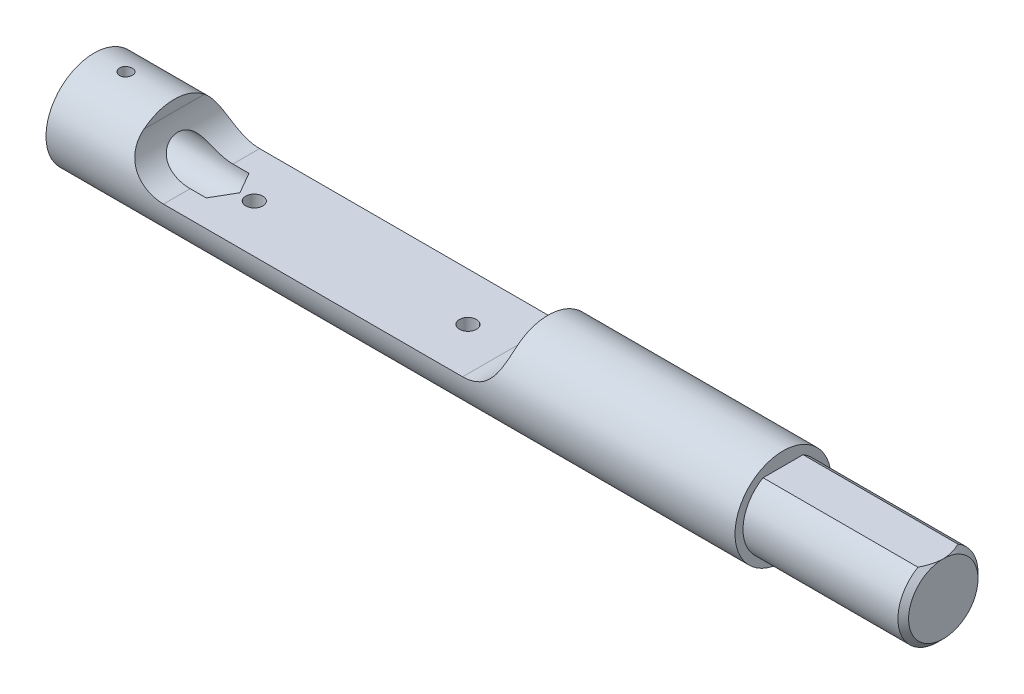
ISO-10303-21;
HEADER;
FILE_DESCRIPTION(('STEP AP214'),'2;1');
FILE_NAME('part.step','',(''),(''),'','','');
FILE_SCHEMA(('AUTOMOTIVE_DESIGN { 1 0 10303 214 1 1 1 1 }'));
ENDSEC;
DATA;
#1=APPLICATION_CONTEXT('core data for automotive mechanical design processes');
#2=APPLICATION_PROTOCOL_DEFINITION('international standard','automotive_design',2000,#1);
#3=PRODUCT_CONTEXT('',#1,'mechanical');
#4=PRODUCT('Part','Part','',(#3));
#5=PRODUCT_RELATED_PRODUCT_CATEGORY('part','',(#4));
#6=PRODUCT_DEFINITION_FORMATION('','',#4);
#7=PRODUCT_DEFINITION_CONTEXT('part definition',#1,'design');
#8=PRODUCT_DEFINITION('design','',#6,#7);
#9=PRODUCT_DEFINITION_SHAPE('','',#8);
#10=(LENGTH_UNIT() NAMED_UNIT(*) SI_UNIT(.MILLI.,.METRE.));
#11=(NAMED_UNIT(*) PLANE_ANGLE_UNIT() SI_UNIT($,.RADIAN.));
#12=(NAMED_UNIT(*) SI_UNIT($,.STERADIAN.) SOLID_ANGLE_UNIT());
#13=UNCERTAINTY_MEASURE_WITH_UNIT(LENGTH_MEASURE(1.E-05),#10,'distance_accuracy_value','');
#14=(GEOMETRIC_REPRESENTATION_CONTEXT(3) GLOBAL_UNCERTAINTY_ASSIGNED_CONTEXT((#13)) GLOBAL_UNIT_ASSIGNED_CONTEXT((#10,
#11,#12)) REPRESENTATION_CONTEXT('',''));
#15=CARTESIAN_POINT('',(0.,0.,0.));
#16=DIRECTION('',(0.,0.,1.));
#17=DIRECTION('',(1.,0.,0.));
#18=AXIS2_PLACEMENT_3D('',#15,#16,#17);
#19=CARTESIAN_POINT('',(0.,0.,0.));
#20=DIRECTION('',(-1.,0.,0.));
#21=DIRECTION('',(0.,0.,0.999999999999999));
#22=AXIS2_PLACEMENT_3D('',#19,#20,#21);
#23=CYLINDRICAL_SURFACE('',#22,9.);
#24=CARTESIAN_POINT('',(68.4,-8.99999999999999,0.));
#25=CARTESIAN_POINT('',(68.4000034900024,-8.9999984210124,0.0891199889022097));
#26=CARTESIAN_POINT('',(68.4074711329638,-8.99866254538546,0.178286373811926));
#27=CARTESIAN_POINT('',(68.4371284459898,-8.99346217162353,0.354112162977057));
#28=CARTESIAN_POINT('',(68.459331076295,-8.98959544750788,0.440769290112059));
#29=CARTESIAN_POINT('',(68.5177617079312,-8.9797664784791,0.609007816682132));
#30=CARTESIAN_POINT('',(68.5539776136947,-8.97380604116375,0.690593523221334));
#31=CARTESIAN_POINT('',(68.6393736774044,-8.9604426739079,0.846521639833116));
#32=CARTESIAN_POINT('',(68.6885525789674,-8.95303988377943,0.920864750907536));
#33=CARTESIAN_POINT('',(68.7990438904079,-8.93752107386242,1.06101042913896));
#34=CARTESIAN_POINT('',(68.8604692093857,-8.92939884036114,1.12672329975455));
#35=CARTESIAN_POINT('',(68.9934667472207,-8.91340337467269,1.24696773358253));
#36=CARTESIAN_POINT('',(69.0650396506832,-8.90553015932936,1.30149854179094));
#37=CARTESIAN_POINT('',(69.2169261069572,-8.89086390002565,1.39819750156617));
#38=CARTESIAN_POINT('',(69.2972978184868,-8.88407887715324,1.44027562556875));
#39=CARTESIAN_POINT('',(69.4641098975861,-8.87244417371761,1.51029875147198));
#40=CARTESIAN_POINT('',(69.5505497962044,-8.86759434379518,1.53824484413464));
#41=CARTESIAN_POINT('',(69.7260889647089,-8.86044137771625,1.57892525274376));
#42=CARTESIAN_POINT('',(69.8151510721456,-8.85811219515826,1.59181525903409));
#43=CARTESIAN_POINT('',(69.9942020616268,-8.85618559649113,1.60250059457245));
#44=CARTESIAN_POINT('',(70.0841908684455,-8.85658796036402,1.60029713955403));
#45=CARTESIAN_POINT('',(70.2614208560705,-8.86005524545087,1.58098461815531));
#46=CARTESIAN_POINT('',(70.348681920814,-8.86308872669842,1.56405155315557));
#47=CARTESIAN_POINT('',(70.5191045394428,-8.87142714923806,1.51603718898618));
#48=CARTESIAN_POINT('',(70.6022659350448,-8.8767321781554,1.48495534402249));
#49=CARTESIAN_POINT('',(70.7626492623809,-8.88904934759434,1.40935057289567));
#50=CARTESIAN_POINT('',(70.8398365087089,-8.89607059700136,1.3647556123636));
#51=CARTESIAN_POINT('',(70.9856989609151,-8.91102292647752,1.26344153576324));
#52=CARTESIAN_POINT('',(71.0543733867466,-8.91895408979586,1.20672130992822));
#53=CARTESIAN_POINT('',(71.1822785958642,-8.93497015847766,1.08181303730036));
#54=CARTESIAN_POINT('',(71.2413621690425,-8.94305565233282,1.0134742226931));
#55=CARTESIAN_POINT('',(71.3472472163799,-8.95836603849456,0.867775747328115));
#56=CARTESIAN_POINT('',(71.3940485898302,-8.96559092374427,0.790416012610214));
#57=CARTESIAN_POINT('',(71.4740583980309,-8.97837847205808,0.628725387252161));
#58=CARTESIAN_POINT('',(71.5072526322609,-8.9839393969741,0.544387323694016));
#59=CARTESIAN_POINT('',(71.5589629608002,-8.99275880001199,0.37121189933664));
#60=CARTESIAN_POINT('',(71.5774804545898,-8.9960174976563,0.282374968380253));
#61=CARTESIAN_POINT('',(71.5991093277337,-8.99983543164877,0.103991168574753));
#62=CARTESIAN_POINT('',(71.6024225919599,-9.00043003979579,0.0144695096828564));
#63=CARTESIAN_POINT('',(71.594088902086,-8.99895010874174,-0.163849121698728));
#64=CARTESIAN_POINT('',(71.5824426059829,-8.99687568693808,-0.252646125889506));
#65=CARTESIAN_POINT('',(71.5446882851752,-8.99031274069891,-0.426362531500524));
#66=CARTESIAN_POINT('',(71.5186813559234,-8.98584109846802,-0.511304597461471));
#67=CARTESIAN_POINT('',(71.4530526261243,-8.97498301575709,-0.675623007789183));
#68=CARTESIAN_POINT('',(71.4134299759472,-8.96859645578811,-0.754999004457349));
#69=CARTESIAN_POINT('',(71.3212402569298,-8.95452886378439,-0.906801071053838));
#70=CARTESIAN_POINT('',(71.2685485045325,-8.94683560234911,-0.979150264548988));
#71=CARTESIAN_POINT('',(71.1518863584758,-8.93104192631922,-1.11405184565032));
#72=CARTESIAN_POINT('',(71.0879150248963,-8.9229414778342,-1.17660341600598));
#73=CARTESIAN_POINT('',(70.949599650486,-8.9071304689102,-1.29089228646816));
#74=CARTESIAN_POINT('',(70.87514153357,-8.89942567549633,-1.34249245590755));
#75=CARTESIAN_POINT('',(70.7184955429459,-8.88539029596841,-1.43245274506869));
#76=CARTESIAN_POINT('',(70.6363079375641,-8.87905966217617,-1.4708133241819));
#77=CARTESIAN_POINT('',(70.4669010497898,-8.86853369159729,-1.53300592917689));
#78=CARTESIAN_POINT('',(70.3797064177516,-8.86432875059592,-1.55690340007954));
#79=CARTESIAN_POINT('',(70.2024587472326,-8.85850726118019,-1.58969535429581));
#80=CARTESIAN_POINT('',(70.1124059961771,-8.85689045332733,-1.59859134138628));
#81=CARTESIAN_POINT('',(69.9333698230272,-8.85644051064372,-1.60108148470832));
#82=CARTESIAN_POINT('',(69.8443894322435,-8.85756806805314,-1.59489171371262));
#83=CARTESIAN_POINT('',(69.6687584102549,-8.86239313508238,-1.56785629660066));
#84=CARTESIAN_POINT('',(69.5821077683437,-8.86609063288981,-1.54701071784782));
#85=CARTESIAN_POINT('',(69.4136964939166,-8.87562318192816,-1.49134260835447));
#86=CARTESIAN_POINT('',(69.3319286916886,-8.88145500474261,-1.45654117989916));
#87=CARTESIAN_POINT('',(69.1753575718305,-8.89460176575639,-1.37397214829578));
#88=CARTESIAN_POINT('',(69.1005546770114,-8.90191679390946,-1.32620375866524));
#89=CARTESIAN_POINT('',(68.9589498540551,-8.91732902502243,-1.21829594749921));
#90=CARTESIAN_POINT('',(68.8922693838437,-8.92543544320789,-1.15799843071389));
#91=CARTESIAN_POINT('',(68.7699001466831,-8.94144596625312,-1.02707564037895));
#92=CARTESIAN_POINT('',(68.7142139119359,-8.94935002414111,-0.95644799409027));
#93=CARTESIAN_POINT('',(68.6150030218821,-8.96413880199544,-0.806197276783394));
#94=CARTESIAN_POINT('',(68.5715788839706,-8.97101489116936,-0.726506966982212));
#95=CARTESIAN_POINT('',(68.4988028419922,-8.98288895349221,-0.560868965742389));
#96=CARTESIAN_POINT('',(68.4694373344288,-8.98788874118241,-0.474927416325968));
#97=CARTESIAN_POINT('',(68.4317735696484,-8.99439282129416,-0.323910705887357));
#98=CARTESIAN_POINT('',(68.4198782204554,-8.99648394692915,-0.259733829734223));
#99=CARTESIAN_POINT('',(68.4039902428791,-8.9992880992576,-0.130379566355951));
#100=CARTESIAN_POINT('',(68.3999974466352,-9.00000115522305,-0.0652022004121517));
#101=CARTESIAN_POINT('',(68.4,-8.99999999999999,0.));
#102=B_SPLINE_CURVE_WITH_KNOTS('',3,(#24,#25,#26,#27,#28,#29,#30,#31,#32,#33,#34,#35,#36,#37,
#38,#39,#40,#41,#42,#43,#44,#45,#46,#47,#48,#49,#50,#51,#52,#53,#54,#55,#56,#57,#58,#59,#60,#61,
#62,#63,#64,#65,#66,#67,#68,#69,#70,#71,#72,#73,#74,#75,#76,#77,#78,#79,#80,#81,#82,#83,#84,#85,
#86,#87,#88,#89,#90,#91,#92,#93,#94,#95,#96,#97,#98,#99,#100,#101),.UNSPECIFIED.,.T.,.F.,(4,2,2,
2,2,2,2,2,2,2,2,2,2,2,2,2,2,2,2,2,2,2,2,2,2,2,2,2,2,2,2,2,2,2,2,2,2,2,4),(0.,0.267121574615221,
0.534478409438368,0.801604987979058,1.06870568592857,1.33839346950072,1.60809945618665,
1.87971016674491,2.15129991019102,2.42005564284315,2.68878972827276,2.95435619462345,
3.21993290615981,3.48695100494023,3.75399355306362,4.02481082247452,4.29563031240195,
4.56673171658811,4.83780726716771,5.10527280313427,5.37272657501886,5.63832110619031,
5.90393221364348,6.17218198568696,6.44045412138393,6.71190959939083,6.98335565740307,
7.25356406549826,7.52374538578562,7.79007970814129,8.05641280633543,8.32234469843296,
8.5882927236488,8.85782605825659,9.1274213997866,9.39916649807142,9.67064811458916,
9.86608445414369,10.0615166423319),.UNSPECIFIED.);
#103=CARTESIAN_POINT('',(68.4,-8.99999999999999,0.));
#104=VERTEX_POINT('',#103);
#105=EDGE_CURVE('E199',#104,#104,#102,.T.);
#106=ORIENTED_EDGE('',*,*,#105,.T.);
#107=EDGE_LOOP('',(#106));
#108=FACE_BOUND('',#107,.T.);
#109=CARTESIAN_POINT('',(28.4,-9.,0.));
#110=CARTESIAN_POINT('',(28.4000034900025,-8.99999842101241,0.089119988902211));
#111=CARTESIAN_POINT('',(28.4074711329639,-8.99866254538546,0.17828637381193));
#112=CARTESIAN_POINT('',(28.4371284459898,-8.99346217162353,0.354112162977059));
#113=CARTESIAN_POINT('',(28.459331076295,-8.98959544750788,0.440769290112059));
#114=CARTESIAN_POINT('',(28.5177617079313,-8.97976647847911,0.609007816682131));
#115=CARTESIAN_POINT('',(28.5539776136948,-8.97380604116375,0.690593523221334));
#116=CARTESIAN_POINT('',(28.6393736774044,-8.9604426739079,0.846521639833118));
#117=CARTESIAN_POINT('',(28.6885525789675,-8.95303988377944,0.920864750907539));
#118=CARTESIAN_POINT('',(28.799043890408,-8.93752107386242,1.06101042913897));
#119=CARTESIAN_POINT('',(28.8604692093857,-8.92939884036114,1.12672329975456));
#120=CARTESIAN_POINT('',(28.9934667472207,-8.91340337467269,1.24696773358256));
#121=CARTESIAN_POINT('',(29.0650396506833,-8.90553015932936,1.301498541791));
#122=CARTESIAN_POINT('',(29.2169261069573,-8.89086390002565,1.39819750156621));
#123=CARTESIAN_POINT('',(29.2972978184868,-8.88407887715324,1.44027562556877));
#124=CARTESIAN_POINT('',(29.4641098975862,-8.87244417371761,1.51029875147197));
#125=CARTESIAN_POINT('',(29.5505497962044,-8.86759434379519,1.53824484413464));
#126=CARTESIAN_POINT('',(29.7260889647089,-8.86044137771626,1.57892525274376));
#127=CARTESIAN_POINT('',(29.8151510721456,-8.85811219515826,1.59181525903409));
#128=CARTESIAN_POINT('',(29.9942020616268,-8.85618559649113,1.60250059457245));
#129=CARTESIAN_POINT('',(30.0841908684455,-8.85658796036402,1.60029713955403));
#130=CARTESIAN_POINT('',(30.2614208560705,-8.86005524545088,1.58098461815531));
#131=CARTESIAN_POINT('',(30.3486819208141,-8.86308872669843,1.56405155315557));
#132=CARTESIAN_POINT('',(30.5191045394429,-8.87142714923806,1.51603718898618));
#133=CARTESIAN_POINT('',(30.6022659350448,-8.87673217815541,1.4849553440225));
#134=CARTESIAN_POINT('',(30.7626492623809,-8.88904934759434,1.40935057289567));
#135=CARTESIAN_POINT('',(30.8398365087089,-8.89607059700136,1.3647556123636));
#136=CARTESIAN_POINT('',(30.9856989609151,-8.91102292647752,1.26344153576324));
#137=CARTESIAN_POINT('',(31.0543733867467,-8.91895408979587,1.20672130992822));
#138=CARTESIAN_POINT('',(31.1822785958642,-8.93497015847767,1.08181303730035));
#139=CARTESIAN_POINT('',(31.2413621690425,-8.94305565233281,1.01347422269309));
#140=CARTESIAN_POINT('',(31.3472472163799,-8.95836603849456,0.867775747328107));
#141=CARTESIAN_POINT('',(31.3940485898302,-8.96559092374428,0.790416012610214));
#142=CARTESIAN_POINT('',(31.474058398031,-8.97837847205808,0.628725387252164));
#143=CARTESIAN_POINT('',(31.5072526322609,-8.9839393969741,0.544387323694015));
#144=CARTESIAN_POINT('',(31.5589629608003,-8.99275880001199,0.371211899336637));
#145=CARTESIAN_POINT('',(31.5774804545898,-8.99601749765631,0.282374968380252));
#146=CARTESIAN_POINT('',(31.5991093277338,-8.99983543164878,0.103991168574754));
#147=CARTESIAN_POINT('',(31.6024225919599,-9.00043003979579,0.0144695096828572));
#148=CARTESIAN_POINT('',(31.594088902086,-8.99895010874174,-0.163849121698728));
#149=CARTESIAN_POINT('',(31.582442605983,-8.99687568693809,-0.252646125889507));
#150=CARTESIAN_POINT('',(31.5446882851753,-8.99031274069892,-0.426362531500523));
#151=CARTESIAN_POINT('',(31.5186813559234,-8.98584109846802,-0.511304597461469));
#152=CARTESIAN_POINT('',(31.4530526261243,-8.97498301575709,-0.675623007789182));
#153=CARTESIAN_POINT('',(31.4134299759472,-8.96859645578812,-0.754999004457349));
#154=CARTESIAN_POINT('',(31.3212402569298,-8.95452886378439,-0.90680107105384));
#155=CARTESIAN_POINT('',(31.2685485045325,-8.94683560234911,-0.979150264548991));
#156=CARTESIAN_POINT('',(31.1518863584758,-8.93104192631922,-1.11405184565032));
#157=CARTESIAN_POINT('',(31.0879150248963,-8.92294147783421,-1.17660341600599));
#158=CARTESIAN_POINT('',(30.9495996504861,-8.90713046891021,-1.29089228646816));
#159=CARTESIAN_POINT('',(30.87514153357,-8.89942567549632,-1.34249245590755));
#160=CARTESIAN_POINT('',(30.7184955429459,-8.88539029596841,-1.43245274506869));
#161=CARTESIAN_POINT('',(30.6363079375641,-8.87905966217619,-1.47081332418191));
#162=CARTESIAN_POINT('',(30.4669010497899,-8.8685336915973,-1.53300592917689));
#163=CARTESIAN_POINT('',(30.3797064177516,-8.86432875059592,-1.55690340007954));
#164=CARTESIAN_POINT('',(30.2024587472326,-8.85850726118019,-1.58969535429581));
#165=CARTESIAN_POINT('',(30.1124059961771,-8.85689045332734,-1.59859134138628));
#166=CARTESIAN_POINT('',(29.9333698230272,-8.85644051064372,-1.60108148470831));
#167=CARTESIAN_POINT('',(29.8443894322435,-8.85756806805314,-1.59489171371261));
#168=CARTESIAN_POINT('',(29.668758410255,-8.86239313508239,-1.56785629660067));
#169=CARTESIAN_POINT('',(29.5821077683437,-8.86609063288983,-1.54701071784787));
#170=CARTESIAN_POINT('',(29.4136964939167,-8.87562318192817,-1.49134260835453));
#171=CARTESIAN_POINT('',(29.3319286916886,-8.88145500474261,-1.45654117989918));
#172=CARTESIAN_POINT('',(29.1753575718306,-8.89460176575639,-1.37397214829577));
#173=CARTESIAN_POINT('',(29.1005546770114,-8.90191679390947,-1.32620375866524));
#174=CARTESIAN_POINT('',(28.9589498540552,-8.91732902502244,-1.21829594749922));
#175=CARTESIAN_POINT('',(28.8922693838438,-8.92543544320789,-1.15799843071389));
#176=CARTESIAN_POINT('',(28.7699001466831,-8.94144596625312,-1.02707564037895));
#177=CARTESIAN_POINT('',(28.714213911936,-8.94935002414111,-0.956447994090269));
#178=CARTESIAN_POINT('',(28.6150030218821,-8.96413880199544,-0.806197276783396));
#179=CARTESIAN_POINT('',(28.5715788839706,-8.97101489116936,-0.726506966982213));
#180=CARTESIAN_POINT('',(28.4988028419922,-8.98288895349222,-0.56086896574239));
#181=CARTESIAN_POINT('',(28.4694373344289,-8.98788874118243,-0.474927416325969));
#182=CARTESIAN_POINT('',(28.4317735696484,-8.99439282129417,-0.323910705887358));
#183=CARTESIAN_POINT('',(28.4198782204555,-8.99648394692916,-0.259733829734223));
#184=CARTESIAN_POINT('',(28.4039902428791,-8.9992880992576,-0.130379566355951));
#185=CARTESIAN_POINT('',(28.3999974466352,-9.00000115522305,-0.0652022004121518));
#186=CARTESIAN_POINT('',(28.4,-9.,0.));
#187=B_SPLINE_CURVE_WITH_KNOTS('',3,(#109,#110,#111,#112,#113,#114,#115,#116,#117,#118,#119,
#120,#121,#122,#123,#124,#125,#126,#127,#128,#129,#130,#131,#132,#133,#134,#135,#136,#137,#138,
#139,#140,#141,#142,#143,#144,#145,#146,#147,#148,#149,#150,#151,#152,#153,#154,#155,#156,#157,
#158,#159,#160,#161,#162,#163,#164,#165,#166,#167,#168,#169,#170,#171,#172,#173,#174,#175,#176,
#177,#178,#179,#180,#181,#182,#183,#184,#185,#186),.UNSPECIFIED.,.T.,.F.,(4,2,2,2,2,2,2,2,2,2,2,
2,2,2,2,2,2,2,2,2,2,2,2,2,2,2,2,2,2,2,2,2,2,2,2,2,2,2,4),(0.,0.267121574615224,
0.534478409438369,0.801604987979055,1.06870568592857,1.33839346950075,1.60809945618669,
1.87971016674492,2.15129991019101,2.42005564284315,2.68878972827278,2.95435619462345,
3.21993290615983,3.48695100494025,3.75399355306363,4.02481082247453,4.29563031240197,
4.56673171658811,4.83780726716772,5.10527280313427,5.37272657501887,5.63832110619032,
5.90393221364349,6.17218198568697,6.44045412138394,6.71190959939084,6.98335565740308,
7.25356406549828,7.52374538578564,7.79007970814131,8.05641280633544,8.32234469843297,
8.58829272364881,8.85782605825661,9.12742139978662,9.39916649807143,9.67064811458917,
9.8660844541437,10.0615166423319),.UNSPECIFIED.);
#188=CARTESIAN_POINT('',(28.4,-9.,0.));
#189=VERTEX_POINT('',#188);
#190=EDGE_CURVE('E125',#189,#189,#187,.T.);
#191=ORIENTED_EDGE('',*,*,#190,.T.);
#192=EDGE_LOOP('',(#191));
#193=FACE_BOUND('',#192,.T.);
#194=CARTESIAN_POINT('',(78.,0.,9.00000000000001));
#195=CARTESIAN_POINT('',(77.8046050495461,1.14168904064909E-06,9.00000144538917));
#196=CARTESIAN_POINT('',(77.609155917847,0.008188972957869,9.00001156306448));
#197=CARTESIAN_POINT('',(77.2195466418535,0.0408948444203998,8.99992151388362));
#198=CARTESIAN_POINT('',(77.0253872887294,0.065422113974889,8.99982128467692));
#199=CARTESIAN_POINT('',(76.6393486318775,0.130718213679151,8.99911004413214));
#200=CARTESIAN_POINT('',(76.4474756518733,0.171524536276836,8.99849785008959));
#201=CARTESIAN_POINT('',(76.0678641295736,0.269082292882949,8.99610872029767));
#202=CARTESIAN_POINT('',(75.8801250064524,0.325831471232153,8.99433194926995));
#203=CARTESIAN_POINT('',(75.5100838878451,0.454871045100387,8.98872962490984));
#204=CARTESIAN_POINT('',(75.3277821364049,0.527162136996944,8.98490397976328));
#205=CARTESIAN_POINT('',(74.9699482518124,0.686746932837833,8.97411672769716));
#206=CARTESIAN_POINT('',(74.7944164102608,0.774041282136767,8.9671549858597));
#207=CARTESIAN_POINT('',(74.4515588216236,0.962877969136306,8.94884656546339));
#208=CARTESIAN_POINT('',(74.284228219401,1.06441173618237,8.93750251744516));
#209=CARTESIAN_POINT('',(73.9589831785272,1.28087974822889,8.90905479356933));
#210=CARTESIAN_POINT('',(73.801068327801,1.39581340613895,8.89195136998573));
#211=CARTESIAN_POINT('',(73.4996561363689,1.63501946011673,8.8510489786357));
#212=CARTESIAN_POINT('',(73.3559017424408,1.7589971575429,8.8274227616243));
#213=CARTESIAN_POINT('',(73.0797425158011,2.01734893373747,8.77198660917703));
#214=CARTESIAN_POINT('',(72.947337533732,2.15172287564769,8.74017678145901));
#215=CARTESIAN_POINT('',(72.6950307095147,2.42917608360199,8.66715973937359));
#216=CARTESIAN_POINT('',(72.5751190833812,2.57224839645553,8.62595996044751));
#217=CARTESIAN_POINT('',(72.3485615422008,2.86532501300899,8.53308416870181));
#218=CARTESIAN_POINT('',(72.241914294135,3.01532861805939,8.48140920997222));
#219=CARTESIAN_POINT('',(72.051469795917,3.30642872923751,8.37194648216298));
#220=CARTESIAN_POINT('',(71.966479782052,3.44711131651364,8.31512788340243));
#221=CARTESIAN_POINT('',(71.808190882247,3.73076858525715,8.19178097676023));
#222=CARTESIAN_POINT('',(71.7348911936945,3.87374310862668,8.12525333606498));
#223=CARTESIAN_POINT('',(71.5999327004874,4.1602436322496,7.98235533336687));
#224=CARTESIAN_POINT('',(71.5382731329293,4.30376959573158,7.90598561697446));
#225=CARTESIAN_POINT('',(71.4262616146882,4.58970069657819,7.74349316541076));
#226=CARTESIAN_POINT('',(71.375909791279,4.73210582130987,7.65737032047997));
#227=CARTESIAN_POINT('',(71.2873893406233,5.00967479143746,7.47860468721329));
#228=CARTESIAN_POINT('',(71.2488799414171,5.14492400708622,7.38626205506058));
#229=CARTESIAN_POINT('',(71.1811959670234,5.41165325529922,7.19313013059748));
#230=CARTESIAN_POINT('',(71.1520211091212,5.54313340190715,7.09234109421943));
#231=CARTESIAN_POINT('',(71.1021477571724,5.801282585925,6.88278773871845));
#232=CARTESIAN_POINT('',(71.0814509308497,5.92795067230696,6.7740218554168));
#233=CARTESIAN_POINT('',(71.0475937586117,6.17557924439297,6.54906200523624));
#234=CARTESIAN_POINT('',(71.0344345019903,6.2965389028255,6.43286696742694));
#235=CARTESIAN_POINT('',(71.0134400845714,6.54656457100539,6.17883876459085));
#236=CARTESIAN_POINT('',(71.0064627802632,6.6747877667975,6.04010521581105));
#237=CARTESIAN_POINT('',(70.9993355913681,6.92232169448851,5.75475020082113));
#238=CARTESIAN_POINT('',(70.9991861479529,7.0416318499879,5.60812822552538));
#239=CARTESIAN_POINT('',(71.0043006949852,7.27080934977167,5.3076414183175));
#240=CARTESIAN_POINT('',(71.0095680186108,7.38067083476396,5.1537721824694));
#241=CARTESIAN_POINT('',(71.0241513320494,7.59041352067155,4.83955725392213));
#242=CARTESIAN_POINT('',(71.0334677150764,7.69029375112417,4.67921093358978));
#243=CARTESIAN_POINT('',(71.0570894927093,7.89961349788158,4.31836443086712));
#244=CARTESIAN_POINT('',(71.0720319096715,8.00665024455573,4.11650783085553));
#245=CARTESIAN_POINT('',(71.1037688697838,8.20502692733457,3.70535404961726));
#246=CARTESIAN_POINT('',(71.1205636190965,8.29636511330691,3.49605604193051));
#247=CARTESIAN_POINT('',(71.1540435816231,8.46290879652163,3.07103905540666));
#248=CARTESIAN_POINT('',(71.1707287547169,8.53810867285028,2.85531786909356));
#249=CARTESIAN_POINT('',(71.2022505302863,8.67192348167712,2.41865532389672));
#250=CARTESIAN_POINT('',(71.2170870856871,8.73053799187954,2.197713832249));
#251=CARTESIAN_POINT('',(71.2448984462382,8.83628135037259,1.72752170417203));
#252=CARTESIAN_POINT('',(71.2574947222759,8.88146507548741,1.4778077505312));
#253=CARTESIAN_POINT('',(71.2771698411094,8.95060245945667,0.975224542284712));
#254=CARTESIAN_POINT('',(71.2842483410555,8.97455479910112,0.722355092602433));
#255=CARTESIAN_POINT('',(71.2920789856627,9.00099698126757,0.215481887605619));
#256=CARTESIAN_POINT('',(71.2928333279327,9.00349427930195,-0.0385214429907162));
#257=CARTESIAN_POINT('',(71.2879344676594,8.98702035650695,-0.545758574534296));
#258=CARTESIAN_POINT('',(71.2822815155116,8.96804997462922,-0.798992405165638));
#259=CARTESIAN_POINT('',(71.2655388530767,8.90994763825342,-1.2932056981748));
#260=CARTESIAN_POINT('',(71.2546631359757,8.87160639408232,-1.53428606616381));
#261=CARTESIAN_POINT('',(71.2287412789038,8.77553547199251,-2.01231568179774));
#262=CARTESIAN_POINT('',(71.2136951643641,8.7178059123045,-2.24926495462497));
#263=CARTESIAN_POINT('',(71.1810599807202,8.58330184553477,-2.71779357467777));
#264=CARTESIAN_POINT('',(71.1634681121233,8.50650630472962,-2.94936668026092));
#265=CARTESIAN_POINT('',(71.127801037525,8.33439117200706,-3.40548754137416));
#266=CARTESIAN_POINT('',(71.1097258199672,8.23907113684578,-3.63003512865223));
#267=CARTESIAN_POINT('',(71.0748917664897,8.02703139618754,-4.07801080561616));
#268=CARTESIAN_POINT('',(71.0581955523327,7.90971234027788,-4.30116060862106));
#269=CARTESIAN_POINT('',(71.0296982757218,7.65658962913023,-4.7371048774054));
#270=CARTESIAN_POINT('',(71.0178977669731,7.52078388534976,-4.94989816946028));
#271=CARTESIAN_POINT('',(71.0023461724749,7.23182526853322,-5.36322566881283));
#272=CARTESIAN_POINT('',(70.9985828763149,7.07869908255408,-5.56377802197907));
#273=CARTESIAN_POINT('',(71.0023906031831,6.75620545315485,-5.95123029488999));
#274=CARTESIAN_POINT('',(71.0099572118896,6.58684435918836,-6.13813550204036));
#275=CARTESIAN_POINT('',(71.0358284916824,6.28083993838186,-6.44865049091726));
#276=CARTESIAN_POINT('',(71.0507288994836,6.14752590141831,-6.57584133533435));
#277=CARTESIAN_POINT('',(71.0897581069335,5.8741162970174,-6.82117769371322));
#278=CARTESIAN_POINT('',(71.1138846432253,5.73402240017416,-6.93932541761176));
#279=CARTESIAN_POINT('',(71.1725828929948,5.44834962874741,-7.1657997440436));
#280=CARTESIAN_POINT('',(71.2071468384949,5.30277490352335,-7.27413357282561));
#281=CARTESIAN_POINT('',(71.2878145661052,5.00751880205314,-7.48045363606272));
#282=CARTESIAN_POINT('',(71.3339185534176,4.85783735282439,-7.57843968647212));
#283=CARTESIAN_POINT('',(71.4388506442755,4.55518475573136,-7.76414861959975));
#284=CARTESIAN_POINT('',(71.4977549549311,4.40219907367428,-7.85180496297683));
#285=CARTESIAN_POINT('',(71.6287002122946,4.09581551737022,-8.01589014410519));
#286=CARTESIAN_POINT('',(71.7007411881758,3.94241764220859,-8.09231895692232));
#287=CARTESIAN_POINT('',(71.8581864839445,3.63732384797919,-8.23396411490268));
#288=CARTESIAN_POINT('',(71.9435899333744,3.48562781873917,-8.29918118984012));
#289=CARTESIAN_POINT('',(72.1276396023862,3.18604118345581,-8.4187383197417));
#290=CARTESIAN_POINT('',(72.2262849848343,3.0381503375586,-8.47307906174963));
#291=CARTESIAN_POINT('',(72.4263168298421,2.76204207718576,-8.56681468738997));
#292=CARTESIAN_POINT('',(72.5265404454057,2.63329520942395,-8.60714159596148));
#293=CARTESIAN_POINT('',(72.7369337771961,2.38188346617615,-8.68007862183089));
#294=CARTESIAN_POINT('',(72.8471037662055,2.2592187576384,-8.71268852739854));
#295=CARTESIAN_POINT('',(73.0767454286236,2.02115239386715,-8.77097306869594));
#296=CARTESIAN_POINT('',(73.1962180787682,1.90575150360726,-8.79664697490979));
#297=CARTESIAN_POINT('',(73.4437198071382,1.68323330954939,-8.84192405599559));
#298=CARTESIAN_POINT('',(73.571749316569,1.57611642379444,-8.8615269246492));
#299=CARTESIAN_POINT('',(73.8403382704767,1.36731101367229,-8.89618264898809));
#300=CARTESIAN_POINT('',(73.9811833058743,1.26595848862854,-8.91104550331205));
#301=CARTESIAN_POINT('',(74.2703505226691,1.07379828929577,-8.93623827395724));
#302=CARTESIAN_POINT('',(74.4186757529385,0.982994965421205,-8.9465663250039));
#303=CARTESIAN_POINT('',(74.7218694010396,0.812584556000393,-8.9636512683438));
#304=CARTESIAN_POINT('',(74.8767395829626,0.732980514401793,-8.97040719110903));
#305=CARTESIAN_POINT('',(75.1919971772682,0.585532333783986,-8.98123685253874));
#306=CARTESIAN_POINT('',(75.3523826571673,0.517684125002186,-8.98531152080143));
#307=CARTESIAN_POINT('',(75.692365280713,0.388587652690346,-8.99186020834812));
#308=CARTESIAN_POINT('',(75.8723973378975,0.328473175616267,-8.99415837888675));
#309=CARTESIAN_POINT('',(76.2367629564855,0.223056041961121,-8.99739006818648));
#310=CARTESIAN_POINT('',(76.421096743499,0.1777541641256,-8.99832351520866));
#311=CARTESIAN_POINT('',(76.7928616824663,0.102261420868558,-8.999498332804));
#312=CARTESIAN_POINT('',(76.9802932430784,0.0720725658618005,-8.99973961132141));
#313=CARTESIAN_POINT('',(77.3569881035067,0.0270149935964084,-8.99998765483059));
#314=CARTESIAN_POINT('',(77.546251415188,0.012146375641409,-8.99999441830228));
#315=CARTESIAN_POINT('',(77.9320805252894,-0.00242540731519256,-9.00000296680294));
#316=CARTESIAN_POINT('',(78.1286675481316,-0.00157279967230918,-9.00000456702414));
#317=CARTESIAN_POINT('',(78.5210778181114,0.0166583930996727,-8.99998911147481));
#318=CARTESIAN_POINT('',(78.7169010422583,0.034037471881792,-8.999972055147));
#319=CARTESIAN_POINT('',(79.106428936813,0.0852036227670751,-8.99963298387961));
#320=CARTESIAN_POINT('',(79.3001332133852,0.118993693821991,-8.99931091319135));
#321=CARTESIAN_POINT('',(79.68401086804,0.202743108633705,-8.9978134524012));
#322=CARTESIAN_POINT('',(79.87418425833,0.252702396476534,-8.99663806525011));
#323=CARTESIAN_POINT('',(80.2499999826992,0.368541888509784,-8.99263806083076));
#324=CARTESIAN_POINT('',(80.4356330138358,0.434452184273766,-8.9898103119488));
#325=CARTESIAN_POINT('',(80.8006415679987,0.581656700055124,-8.98148687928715));
#326=CARTESIAN_POINT('',(80.9800170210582,0.662951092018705,-8.97599116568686));
#327=CARTESIAN_POINT('',(81.3311665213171,0.840290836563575,-8.96112855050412));
#328=CARTESIAN_POINT('',(81.5029404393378,0.936336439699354,-8.95176158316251));
#329=CARTESIAN_POINT('',(81.8375399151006,1.14236546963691,-8.92780771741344));
#330=CARTESIAN_POINT('',(82.0003657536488,1.25234845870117,-8.91322098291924));
#331=CARTESIAN_POINT('',(82.3121975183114,1.4826033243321,-8.87778927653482));
#332=CARTESIAN_POINT('',(82.4614318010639,1.60258839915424,-8.85709232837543));
#333=CARTESIAN_POINT('',(82.7488783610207,1.85368423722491,-8.80796299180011));
#334=CARTESIAN_POINT('',(82.887090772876,1.98479486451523,-8.7795306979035));
#335=CARTESIAN_POINT('',(83.1512479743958,2.25652924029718,-8.71364425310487));
#336=CARTESIAN_POINT('',(83.2772035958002,2.39714439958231,-8.67619817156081));
#337=CARTESIAN_POINT('',(83.5160019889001,2.6862019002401,-8.5911001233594));
#338=CARTESIAN_POINT('',(83.6288460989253,2.83464344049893,-8.54344919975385));
#339=CARTESIAN_POINT('',(83.8314760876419,3.12413334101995,-8.44163758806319));
#340=CARTESIAN_POINT('',(83.9224136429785,3.26470281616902,-8.38840274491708));
#341=CARTESIAN_POINT('',(84.0924197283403,3.5489365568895,-8.27215902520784));
#342=CARTESIAN_POINT('',(84.1714890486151,3.69260061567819,-8.20915079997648));
#343=CARTESIAN_POINT('',(84.3176853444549,3.98122178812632,-8.07312329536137));
#344=CARTESIAN_POINT('',(84.3848140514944,4.12617871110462,-8.00010547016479));
#345=CARTESIAN_POINT('',(84.5073642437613,4.4156403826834,-7.84405201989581));
#346=CARTESIAN_POINT('',(84.5627857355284,4.56014513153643,-7.76101640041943));
#347=CARTESIAN_POINT('',(84.6601479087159,4.84049917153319,-7.58916094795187));
#348=CARTESIAN_POINT('',(84.7025872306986,4.97644312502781,-7.50077620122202));
#349=CARTESIAN_POINT('',(84.777886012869,5.2450861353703,-7.31544260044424));
#350=CARTESIAN_POINT('',(84.810745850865,5.3777853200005,-7.21849408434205));
#351=CARTESIAN_POINT('',(84.8676834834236,5.63883221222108,-7.01646774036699));
#352=CARTESIAN_POINT('',(84.89175956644,5.76717906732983,-6.9113883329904));
#353=CARTESIAN_POINT('',(84.9320257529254,6.01855820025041,-6.69362534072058));
#354=CARTESIAN_POINT('',(84.9482147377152,6.14158972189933,-6.58094067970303));
#355=CARTESIAN_POINT('',(84.9750446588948,6.39450532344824,-6.33597247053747));
#356=CARTESIAN_POINT('',(84.9848979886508,6.52369533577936,-6.20288638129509));
#357=CARTESIAN_POINT('',(84.9974628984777,6.7737493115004,-5.92880623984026));
#358=CARTESIAN_POINT('',(85.0001740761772,6.89461280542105,-5.78781174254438));
#359=CARTESIAN_POINT('',(84.9998085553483,7.12743991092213,-5.49855337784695));
#360=CARTESIAN_POINT('',(84.9967287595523,7.23939872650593,-5.3502856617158));
#361=CARTESIAN_POINT('',(84.986095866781,7.45386563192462,-5.04721319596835));
#362=CARTESIAN_POINT('',(84.978542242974,7.55637260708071,-4.89240767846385));
#363=CARTESIAN_POINT('',(84.9583210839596,7.77188179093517,-4.54401683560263));
#364=CARTESIAN_POINT('',(84.9449160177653,7.88262172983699,-4.34907112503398));
#365=CARTESIAN_POINT('',(84.9155302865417,8.08918663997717,-3.95161182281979));
#366=CARTESIAN_POINT('',(84.899549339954,8.18500997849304,-3.74909740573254));
#367=CARTESIAN_POINT('',(84.8669382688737,8.36132443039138,-3.33742625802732));
#368=CARTESIAN_POINT('',(84.8503078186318,8.44180772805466,-3.12826620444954));
#369=CARTESIAN_POINT('',(84.8181407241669,8.58697328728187,-2.70445332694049));
#370=CARTESIAN_POINT('',(84.8026040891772,8.65165541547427,-2.48980045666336));
#371=CARTESIAN_POINT('',(84.7722906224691,8.77212824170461,-2.02822871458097));
#372=CARTESIAN_POINT('',(84.7578675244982,8.82571073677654,-1.78070591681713));
#373=CARTESIAN_POINT('',(84.7340042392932,8.91185482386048,-1.28177150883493));
#374=CARTESIAN_POINT('',(84.7245644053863,8.94441492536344,-1.03035962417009));
#375=CARTESIAN_POINT('',(84.7117481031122,8.98820585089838,-0.525632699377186));
#376=CARTESIAN_POINT('',(84.7083690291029,8.99944584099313,-0.272318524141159));
#377=CARTESIAN_POINT('',(84.7080507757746,9.00051411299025,0.234349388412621));
#378=CARTESIAN_POINT('',(84.7111112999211,8.99034338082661,0.487703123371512));
#379=CARTESIAN_POINT('',(84.7231190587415,8.94938451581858,0.984109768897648));
#380=CARTESIAN_POINT('',(84.7318674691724,8.91929213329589,1.22722539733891));
#381=CARTESIAN_POINT('',(84.7541206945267,8.83944744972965,1.70997878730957));
#382=CARTESIAN_POINT('',(84.7676255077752,8.78969515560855,1.94961655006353));
#383=CARTESIAN_POINT('',(84.7979417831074,8.67085163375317,2.42408964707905));
#384=CARTESIAN_POINT('',(84.8147566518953,8.60174045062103,2.65891975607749));
#385=CARTESIAN_POINT('',(84.8497739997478,8.44466760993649,3.12208121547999));
#386=CARTESIAN_POINT('',(84.8679765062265,8.35670557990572,3.35041243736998));
#387=CARTESIAN_POINT('',(84.903931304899,8.16014972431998,3.80455259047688));
#388=CARTESIAN_POINT('',(84.9216626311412,8.05111543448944,4.03017276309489));
#389=CARTESIAN_POINT('',(84.9534795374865,7.81447557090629,4.47176948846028));
#390=CARTESIAN_POINT('',(84.9675647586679,7.68686817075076,4.68774509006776));
#391=CARTESIAN_POINT('',(84.9890812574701,7.41405508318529,5.10828048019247));
#392=CARTESIAN_POINT('',(84.9965206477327,7.26887109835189,5.31285390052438));
#393=CARTESIAN_POINT('',(85.0015778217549,6.96186524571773,5.70922136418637));
#394=CARTESIAN_POINT('',(84.9991988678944,6.80004892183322,5.90101963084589));
#395=CARTESIAN_POINT('',(84.9835029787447,6.50296565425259,6.22472061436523));
#396=CARTESIAN_POINT('',(84.9730185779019,6.37095051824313,6.35975695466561));
#397=CARTESIAN_POINT('',(84.9431467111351,6.09923130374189,6.62078869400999));
#398=CARTESIAN_POINT('',(84.9237613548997,5.95952905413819,6.74678622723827));
#399=CARTESIAN_POINT('',(84.8747255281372,5.67366724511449,6.98888790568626));
#400=CARTESIAN_POINT('',(84.8450827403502,5.52751258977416,7.10499937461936));
#401=CARTESIAN_POINT('',(84.7742707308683,5.23007919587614,7.32670942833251));
#402=CARTESIAN_POINT('',(84.7331013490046,5.07880038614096,7.43230786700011));
#403=CARTESIAN_POINT('',(84.6378433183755,4.77176111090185,7.63309753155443));
#404=CARTESIAN_POINT('',(84.5836648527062,4.61597642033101,7.72820938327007));
#405=CARTESIAN_POINT('',(84.4617627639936,4.30299825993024,7.90674794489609));
#406=CARTESIAN_POINT('',(84.3940391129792,4.14580478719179,7.99017463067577));
#407=CARTESIAN_POINT('',(84.2446433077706,3.8322597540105,8.14520532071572));
#408=CARTESIAN_POINT('',(84.1629741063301,3.67590802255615,8.21681182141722));
#409=CARTESIAN_POINT('',(83.9856509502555,3.36629712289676,8.34843332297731));
#410=CARTESIAN_POINT('',(83.8899981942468,3.2130376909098,8.40844931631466));
#411=CARTESIAN_POINT('',(83.6965250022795,2.92866155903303,8.51135701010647));
#412=CARTESIAN_POINT('',(83.6001411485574,2.79698423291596,8.55541283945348));
#413=CARTESIAN_POINT('',(83.3970747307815,2.53922659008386,8.6354235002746));
#414=CARTESIAN_POINT('',(83.2903920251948,2.41314635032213,8.67137822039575));
#415=CARTESIAN_POINT('',(83.067344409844,2.16786772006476,8.73592800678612));
#416=CARTESIAN_POINT('',(82.9509795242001,2.04866931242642,8.76452309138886));
#417=CARTESIAN_POINT('',(82.7092829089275,1.81824972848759,8.81520776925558));
#418=CARTESIAN_POINT('',(82.5839507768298,1.70702891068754,8.83729707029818));
#419=CARTESIAN_POINT('',(82.3223347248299,1.49120773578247,8.87629341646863));
#420=CARTESIAN_POINT('',(82.1858736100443,1.38680044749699,8.89307919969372));
#421=CARTESIAN_POINT('',(81.9052452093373,1.18806076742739,8.92180473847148));
#422=CARTESIAN_POINT('',(81.7610748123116,1.09373248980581,8.93374252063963));
#423=CARTESIAN_POINT('',(81.4658909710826,0.915814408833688,8.95373134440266));
#424=CARTESIAN_POINT('',(81.3148737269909,0.832230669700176,8.96178019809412));
#425=CARTESIAN_POINT('',(81.0069707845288,0.676401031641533,8.97488700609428));
#426=CARTESIAN_POINT('',(80.8500847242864,0.604155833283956,8.97994477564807));
#427=CARTESIAN_POINT('',(80.5167454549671,0.465361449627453,8.98825410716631));
#428=CARTESIAN_POINT('',(80.3398163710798,0.399940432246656,8.99129774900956));
#429=CARTESIAN_POINT('',(79.981207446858,0.283575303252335,8.99571996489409));
#430=CARTESIAN_POINT('',(79.7995267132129,0.232633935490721,8.9970982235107));
#431=CARTESIAN_POINT('',(79.4330015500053,0.14566421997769,8.99892607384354));
#432=CARTESIAN_POINT('',(79.2481638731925,0.109607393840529,8.99937744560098));
#433=CARTESIAN_POINT('',(78.8762581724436,0.0525159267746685,8.99989242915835));
#434=CARTESIAN_POINT('',(78.6891913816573,0.0314733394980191,8.99995624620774));
#435=CARTESIAN_POINT('',(78.4181598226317,0.011999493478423,8.99999347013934));
#436=CARTESIAN_POINT('',(78.334593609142,0.0075005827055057,8.99999739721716));
#437=CARTESIAN_POINT('',(78.1673549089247,0.00150060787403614,9.00000035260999));
#438=CARTESIAN_POINT('',(78.0836824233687,-4.88954804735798E-07,8.99999938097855));
#439=CARTESIAN_POINT('',(78.,0.,9.00000000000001));
#440=B_SPLINE_CURVE_WITH_KNOTS('',3,(#194,#195,#196,#197,#198,#199,#200,#201,#202,#203,#204,
#205,#206,#207,#208,#209,#210,#211,#212,#213,#214,#215,#216,#217,#218,#219,#220,#221,#222,#223,
#224,#225,#226,#227,#228,#229,#230,#231,#232,#233,#234,#235,#236,#237,#238,#239,#240,#241,#242,
#243,#244,#245,#246,#247,#248,#249,#250,#251,#252,#253,#254,#255,#256,#257,#258,#259,#260,#261,
#262,#263,#264,#265,#266,#267,#268,#269,#270,#271,#272,#273,#274,#275,#276,#277,#278,#279,#280,
#281,#282,#283,#284,#285,#286,#287,#288,#289,#290,#291,#292,#293,#294,#295,#296,#297,#298,#299,
#300,#301,#302,#303,#304,#305,#306,#307,#308,#309,#310,#311,#312,#313,#314,#315,#316,#317,#318,
#319,#320,#321,#322,#323,#324,#325,#326,#327,#328,#329,#330,#331,#332,#333,#334,#335,#336,#337,
#338,#339,#340,#341,#342,#343,#344,#345,#346,#347,#348,#349,#350,#351,#352,#353,#354,#355,#356,
#357,#358,#359,#360,#361,#362,#363,#364,#365,#366,#367,#368,#369,#370,#371,#372,#373,#374,#375,
#376,#377,#378,#379,#380,#381,#382,#383,#384,#385,#386,#387,#388,#389,#390,#391,#392,#393,#394,
#395,#396,#397,#398,#399,#400,#401,#402,#403,#404,#405,#406,#407,#408,#409,#410,#411,#412,#413,
#414,#415,#416,#417,#418,#419,#420,#421,#422,#423,#424,#425,#426,#427,#428,#429,#430,#431,#432,
#433,#434,#435,#436,#437,#438,#439),.UNSPECIFIED.,.T.,.F.,(4,2,2,2,2,2,2,2,2,2,2,2,2,2,2,2,2,2,
2,2,2,2,2,2,2,2,2,2,2,2,2,2,2,2,2,2,2,2,2,2,2,2,2,2,2,2,2,2,2,2,2,2,2,2,2,2,2,2,2,2,2,2,2,2,2,2,
2,2,2,2,2,2,2,2,2,2,2,2,2,2,2,2,2,2,2,2,2,2,2,2,2,2,2,2,2,2,2,2,2,2,2,2,2,2,2,2,2,2,2,2,2,2,2,2,
2,2,2,2,2,2,2,2,4),(0.,0.586107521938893,1.17254638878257,1.76034375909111,2.34805800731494,
2.9357985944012,3.52356446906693,4.11097807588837,4.69836595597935,5.27148424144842,
5.84459498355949,6.4172534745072,6.98985436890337,7.51090445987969,8.03191876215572,
8.55289890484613,9.07388491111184,9.57805553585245,10.0822108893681,10.5864653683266,
11.0907927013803,11.6573822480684,12.2240084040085,12.7909834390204,13.3580135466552,
14.0442162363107,14.7304953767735,15.4170131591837,16.1035484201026,16.8648250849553,
17.6261490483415,18.3872084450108,19.1482381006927,19.8804480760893,20.6126535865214,
21.3456704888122,22.078704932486,22.835782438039,23.5929455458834,24.3489575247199,
25.1046750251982,25.6587292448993,26.2126476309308,26.7661547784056,27.3196717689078,
27.8765791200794,28.4334877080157,28.9903600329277,29.5471971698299,30.0508201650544,
30.554456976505,31.058146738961,31.561861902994,32.0837780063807,32.6059085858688,
33.1281808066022,33.6502718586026,34.2190792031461,34.787916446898,35.3568293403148,
35.9257459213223,36.5148120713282,37.103895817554,37.693087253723,38.2822766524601,
38.8725863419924,39.4629026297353,40.0532289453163,40.6435367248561,41.2205771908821,
41.7976106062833,42.3741293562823,42.9505892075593,43.4769428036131,44.0032613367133,
44.5295034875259,45.0557453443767,45.558043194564,46.0603212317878,46.56269708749,
47.0651441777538,47.6218327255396,48.1785526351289,48.7355703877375,49.2926537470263,
49.9657907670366,50.6390014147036,51.3125541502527,51.9861125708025,52.7461600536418,
53.5062614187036,54.266035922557,55.025775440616,55.7602901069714,56.4948045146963,
57.230078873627,57.9653677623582,58.718123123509,59.4709525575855,60.2228617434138,
60.9745211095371,61.5414072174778,62.1081590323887,62.6744872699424,63.2408233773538,
63.8111880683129,64.3815539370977,64.9517991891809,65.5219955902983,66.028476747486,
66.5349648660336,67.0414517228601,67.5479613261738,68.0653305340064,68.5829101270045,
69.1007805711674,69.6186830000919,70.1840317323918,70.7494875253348,71.3138563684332,
71.8779262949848,72.1289431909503,72.3799573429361),.UNSPECIFIED.);
#441=CARTESIAN_POINT('',(77.9999999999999,0.,-9.00000000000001));
#442=VERTEX_POINT('',#441);
#443=CARTESIAN_POINT('',(85.,7.00000000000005,-5.65685424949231));
#444=VERTEX_POINT('',#443);
#445=EDGE_CURVE('E130',#442,#444,#440,.T.);
#446=ORIENTED_EDGE('',*,*,#445,.T.);
#447=CARTESIAN_POINT('',(85.,0.,0.));
#448=DIRECTION('',(1.,0.,0.));
#449=DIRECTION('',(0.,0.,-0.999999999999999));
#450=AXIS2_PLACEMENT_3D('',#447,#448,#449);
#451=CIRCLE('',#450,9.);
#452=CARTESIAN_POINT('',(85.,7.00000000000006,5.65685424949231));
#453=VERTEX_POINT('',#452);
#454=EDGE_CURVE('E141',#444,#453,#451,.T.);
#455=ORIENTED_EDGE('',*,*,#454,.T.);
#456=CARTESIAN_POINT('',(78.,0.,9.00000000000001));
#457=VERTEX_POINT('',#456);
#458=EDGE_CURVE('E133',#453,#457,#440,.T.);
#459=ORIENTED_EDGE('',*,*,#458,.T.);
#460=DIRECTION('',(1.,0.,0.));
#461=VECTOR('',#460,1.);
#462=CARTESIAN_POINT('',(22.,0.,9.00000000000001));
#463=LINE('',#462,#461);
#464=CARTESIAN_POINT('',(22.,0.,9.00000000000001));
#465=VERTEX_POINT('',#464);
#466=EDGE_CURVE('E175',#465,#457,#463,.T.);
#467=ORIENTED_EDGE('',*,*,#466,.F.);
#468=CARTESIAN_POINT('',(22.,0.,9.00000000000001));
#469=CARTESIAN_POINT('',(21.8046050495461,1.14168904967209E-06,9.00000144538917));
#470=CARTESIAN_POINT('',(21.609155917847,0.00818897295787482,9.00001156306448));
#471=CARTESIAN_POINT('',(21.2195466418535,0.0408948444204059,8.99992151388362));
#472=CARTESIAN_POINT('',(21.0253872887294,0.0654221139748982,8.99982128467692));
#473=CARTESIAN_POINT('',(20.6393486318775,0.13071821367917,8.99911004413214));
#474=CARTESIAN_POINT('',(20.4474756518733,0.171524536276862,8.99849785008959));
#475=CARTESIAN_POINT('',(20.0678641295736,0.269082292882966,8.99610872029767));
#476=CARTESIAN_POINT('',(19.8801250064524,0.325831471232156,8.99433194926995));
#477=CARTESIAN_POINT('',(19.5100838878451,0.454871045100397,8.98872962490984));
#478=CARTESIAN_POINT('',(19.327782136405,0.527162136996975,8.98490397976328));
#479=CARTESIAN_POINT('',(18.9699482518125,0.686746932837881,8.97411672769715));
#480=CARTESIAN_POINT('',(18.7944164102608,0.77404128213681,8.9671549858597));
#481=CARTESIAN_POINT('',(18.4515588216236,0.962877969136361,8.94884656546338));
#482=CARTESIAN_POINT('',(18.284228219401,1.06441173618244,8.93750251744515));
#483=CARTESIAN_POINT('',(17.9589831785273,1.28087974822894,8.90905479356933));
#484=CARTESIAN_POINT('',(17.801068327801,1.39581340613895,8.89195136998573));
#485=CARTESIAN_POINT('',(17.4996561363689,1.63501946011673,8.8510489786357));
#486=CARTESIAN_POINT('',(17.3559017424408,1.75899715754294,8.82742276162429));
#487=CARTESIAN_POINT('',(17.0797425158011,2.01734893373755,8.77198660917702));
#488=CARTESIAN_POINT('',(16.947337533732,2.15172287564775,8.740176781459));
#489=CARTESIAN_POINT('',(16.6950307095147,2.42917608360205,8.66715973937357));
#490=CARTESIAN_POINT('',(16.5751190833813,2.57224839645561,8.62595996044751));
#491=CARTESIAN_POINT('',(16.3485615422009,2.86532501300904,8.53308416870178));
#492=CARTESIAN_POINT('',(16.241914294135,3.01532861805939,8.48140920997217));
#493=CARTESIAN_POINT('',(16.0514697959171,3.3064287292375,8.37194648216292));
#494=CARTESIAN_POINT('',(15.9664797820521,3.44711131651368,8.3151278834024));
#495=CARTESIAN_POINT('',(15.8081908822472,3.73076858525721,8.19178097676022));
#496=CARTESIAN_POINT('',(15.7348911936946,3.87374310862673,8.12525333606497));
#497=CARTESIAN_POINT('',(15.5999327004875,4.16024363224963,7.98235533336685));
#498=CARTESIAN_POINT('',(15.5382731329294,4.30376959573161,7.90598561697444));
#499=CARTESIAN_POINT('',(15.4262616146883,4.58970069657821,7.74349316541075));
#500=CARTESIAN_POINT('',(15.3759097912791,4.73210582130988,7.65737032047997));
#501=CARTESIAN_POINT('',(15.2873893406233,5.00967479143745,7.47860468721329));
#502=CARTESIAN_POINT('',(15.2488799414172,5.14492400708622,7.38626205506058));
#503=CARTESIAN_POINT('',(15.1811959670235,5.41165325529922,7.19313013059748));
#504=CARTESIAN_POINT('',(15.1520211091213,5.54313340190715,7.09234109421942));
#505=CARTESIAN_POINT('',(15.1021477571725,5.801282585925,6.88278773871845));
#506=CARTESIAN_POINT('',(15.0814509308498,5.92795067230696,6.7740218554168));
#507=CARTESIAN_POINT('',(15.0475937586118,6.17557924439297,6.54906200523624));
#508=CARTESIAN_POINT('',(15.0344345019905,6.2965389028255,6.43286696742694));
#509=CARTESIAN_POINT('',(15.0134400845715,6.54656457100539,6.17883876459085));
#510=CARTESIAN_POINT('',(15.0064627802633,6.6747877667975,6.04010521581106));
#511=CARTESIAN_POINT('',(14.9993355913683,6.92232169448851,5.75475020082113));
#512=CARTESIAN_POINT('',(14.9991861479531,7.0416318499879,5.60812822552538));
#513=CARTESIAN_POINT('',(15.0043006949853,7.27080934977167,5.30764141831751));
#514=CARTESIAN_POINT('',(15.0095680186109,7.38067083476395,5.1537721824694));
#515=CARTESIAN_POINT('',(15.0241513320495,7.59041352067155,4.83955725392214));
#516=CARTESIAN_POINT('',(15.0334677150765,7.69029375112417,4.67921093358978));
#517=CARTESIAN_POINT('',(15.0570894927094,7.89961349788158,4.31836443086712));
#518=CARTESIAN_POINT('',(15.0720319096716,8.00665024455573,4.11650783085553));
#519=CARTESIAN_POINT('',(15.103768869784,8.20502692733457,3.70535404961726));
#520=CARTESIAN_POINT('',(15.1205636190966,8.29636511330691,3.49605604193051));
#521=CARTESIAN_POINT('',(15.1540435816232,8.46290879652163,3.07103905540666));
#522=CARTESIAN_POINT('',(15.170728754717,8.53810867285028,2.85531786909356));
#523=CARTESIAN_POINT('',(15.2022505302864,8.67192348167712,2.41865532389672));
#524=CARTESIAN_POINT('',(15.2170870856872,8.73053799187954,2.197713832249));
#525=CARTESIAN_POINT('',(15.2448984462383,8.83628135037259,1.72752170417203));
#526=CARTESIAN_POINT('',(15.257494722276,8.88146507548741,1.4778077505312));
#527=CARTESIAN_POINT('',(15.2771698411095,8.95060245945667,0.975224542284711));
#528=CARTESIAN_POINT('',(15.2842483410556,8.97455479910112,0.72235509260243));
#529=CARTESIAN_POINT('',(15.2920789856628,9.00099698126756,0.215481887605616));
#530=CARTESIAN_POINT('',(15.2928333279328,9.00349427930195,-0.0385214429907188));
#531=CARTESIAN_POINT('',(15.2879344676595,8.98702035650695,-0.545758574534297));
#532=CARTESIAN_POINT('',(15.2822815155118,8.96804997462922,-0.798992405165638));
#533=CARTESIAN_POINT('',(15.2655388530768,8.90994763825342,-1.2932056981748));
#534=CARTESIAN_POINT('',(15.2546631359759,8.87160639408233,-1.53428606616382));
#535=CARTESIAN_POINT('',(15.2287412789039,8.77553547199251,-2.01231568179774));
#536=CARTESIAN_POINT('',(15.2136951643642,8.7178059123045,-2.24926495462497));
#537=CARTESIAN_POINT('',(15.1810599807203,8.58330184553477,-2.71779357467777));
#538=CARTESIAN_POINT('',(15.1634681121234,8.50650630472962,-2.94936668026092));
#539=CARTESIAN_POINT('',(15.1278010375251,8.33439117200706,-3.40548754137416));
#540=CARTESIAN_POINT('',(15.1097258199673,8.23907113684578,-3.63003512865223));
#541=CARTESIAN_POINT('',(15.0748917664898,8.02703139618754,-4.07801080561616));
#542=CARTESIAN_POINT('',(15.0581955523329,7.90971234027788,-4.30116060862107));
#543=CARTESIAN_POINT('',(15.0296982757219,7.65658962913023,-4.73710487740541));
#544=CARTESIAN_POINT('',(15.0178977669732,7.52078388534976,-4.94989816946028));
#545=CARTESIAN_POINT('',(15.002346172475,7.23182526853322,-5.36322566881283));
#546=CARTESIAN_POINT('',(14.998582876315,7.07869908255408,-5.56377802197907));
#547=CARTESIAN_POINT('',(15.0023906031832,6.75620545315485,-5.95123029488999));
#548=CARTESIAN_POINT('',(15.0099572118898,6.58684435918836,-6.13813550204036));
#549=CARTESIAN_POINT('',(15.0358284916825,6.28083993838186,-6.44865049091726));
#550=CARTESIAN_POINT('',(15.0507288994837,6.14752590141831,-6.57584133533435));
#551=CARTESIAN_POINT('',(15.0897581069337,5.8741162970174,-6.82117769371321));
#552=CARTESIAN_POINT('',(15.1138846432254,5.73402240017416,-6.93932541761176));
#553=CARTESIAN_POINT('',(15.172582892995,5.44834962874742,-7.1657997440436));
#554=CARTESIAN_POINT('',(15.207146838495,5.30277490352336,-7.27413357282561));
#555=CARTESIAN_POINT('',(15.2878145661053,5.00751880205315,-7.48045363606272));
#556=CARTESIAN_POINT('',(15.3339185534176,4.85783735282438,-7.57843968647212));
#557=CARTESIAN_POINT('',(15.4388506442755,4.55518475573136,-7.76414861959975));
#558=CARTESIAN_POINT('',(15.4977549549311,4.4021990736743,-7.85180496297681));
#559=CARTESIAN_POINT('',(15.6287002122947,4.09581551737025,-8.01589014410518));
#560=CARTESIAN_POINT('',(15.7007411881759,3.94241764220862,-8.09231895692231));
#561=CARTESIAN_POINT('',(15.8581864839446,3.63732384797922,-8.23396411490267));
#562=CARTESIAN_POINT('',(15.9435899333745,3.48562781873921,-8.29918118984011));
#563=CARTESIAN_POINT('',(16.1276396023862,3.18604118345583,-8.41873831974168));
#564=CARTESIAN_POINT('',(16.2262849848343,3.0381503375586,-8.47307906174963));
#565=CARTESIAN_POINT('',(16.4263168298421,2.76204207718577,-8.56681468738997));
#566=CARTESIAN_POINT('',(16.5265404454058,2.63329520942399,-8.60714159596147));
#567=CARTESIAN_POINT('',(16.7369337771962,2.3818834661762,-8.68007862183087));
#568=CARTESIAN_POINT('',(16.8471037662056,2.25921875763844,-8.71268852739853));
#569=CARTESIAN_POINT('',(17.0767454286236,2.02115239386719,-8.77097306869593));
#570=CARTESIAN_POINT('',(17.1962180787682,1.9057515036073,-8.79664697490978));
#571=CARTESIAN_POINT('',(17.4437198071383,1.68323330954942,-8.84192405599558));
#572=CARTESIAN_POINT('',(17.571749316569,1.57611642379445,-8.8615269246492));
#573=CARTESIAN_POINT('',(17.8403382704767,1.3673110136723,-8.89618264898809));
#574=CARTESIAN_POINT('',(17.9811833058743,1.26595848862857,-8.91104550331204));
#575=CARTESIAN_POINT('',(18.2703505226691,1.07379828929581,-8.93623827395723));
#576=CARTESIAN_POINT('',(18.4186757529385,0.982994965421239,-8.9465663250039));
#577=CARTESIAN_POINT('',(18.7218694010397,0.812584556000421,-8.96365126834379));
#578=CARTESIAN_POINT('',(18.8767395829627,0.732980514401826,-8.97040719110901));
#579=CARTESIAN_POINT('',(19.1919971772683,0.58553233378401,-8.98123685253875));
#580=CARTESIAN_POINT('',(19.3523826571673,0.517684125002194,-8.98531152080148));
#581=CARTESIAN_POINT('',(19.692365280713,0.388587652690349,-8.99186020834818));
#582=CARTESIAN_POINT('',(19.8723973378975,0.328473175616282,-8.99415837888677));
#583=CARTESIAN_POINT('',(20.2367629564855,0.223056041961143,-8.99739006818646));
#584=CARTESIAN_POINT('',(20.421096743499,0.177754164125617,-8.99832351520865));
#585=CARTESIAN_POINT('',(20.7928616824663,0.102261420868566,-8.999498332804));
#586=CARTESIAN_POINT('',(20.9802932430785,0.0720725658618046,-8.99973961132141));
#587=CARTESIAN_POINT('',(21.3569881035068,0.0270149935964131,-8.99998765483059));
#588=CARTESIAN_POINT('',(21.546251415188,0.0121463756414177,-8.99999441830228));
#589=CARTESIAN_POINT('',(21.9320805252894,-0.0024254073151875,-9.00000296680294));
#590=CARTESIAN_POINT('',(22.1286675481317,-0.00157279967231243,-9.00000456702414));
#591=CARTESIAN_POINT('',(22.5210778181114,0.0166583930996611,-8.99998911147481));
#592=CARTESIAN_POINT('',(22.7169010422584,0.0340374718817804,-8.999972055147));
#593=CARTESIAN_POINT('',(23.106428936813,0.0852036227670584,-8.99963298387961));
#594=CARTESIAN_POINT('',(23.3001332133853,0.118993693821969,-8.99931091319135));
#595=CARTESIAN_POINT('',(23.68401086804,0.202743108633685,-8.9978134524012));
#596=CARTESIAN_POINT('',(23.87418425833,0.252702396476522,-8.99663806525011));
#597=CARTESIAN_POINT('',(24.2499999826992,0.368541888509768,-8.99263806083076));
#598=CARTESIAN_POINT('',(24.4356330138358,0.43445218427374,-8.9898103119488));
#599=CARTESIAN_POINT('',(24.8006415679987,0.581656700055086,-8.98148687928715));
#600=CARTESIAN_POINT('',(24.9800170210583,0.662951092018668,-8.97599116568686));
#601=CARTESIAN_POINT('',(25.3311665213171,0.84029083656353,-8.96112855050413));
#602=CARTESIAN_POINT('',(25.5029404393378,0.936336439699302,-8.95176158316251));
#603=CARTESIAN_POINT('',(25.8375399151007,1.14236546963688,-8.92780771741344));
#604=CARTESIAN_POINT('',(26.0003657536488,1.25234845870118,-8.91322098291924));
#605=CARTESIAN_POINT('',(26.3121975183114,1.48260332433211,-8.87778927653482));
#606=CARTESIAN_POINT('',(26.461431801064,1.60258839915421,-8.85709232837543));
#607=CARTESIAN_POINT('',(26.7488783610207,1.85368423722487,-8.80796299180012));
#608=CARTESIAN_POINT('',(26.8870907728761,1.9847948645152,-8.77953069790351));
#609=CARTESIAN_POINT('',(27.1512479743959,2.25652924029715,-8.71364425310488));
#610=CARTESIAN_POINT('',(27.2772035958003,2.39714439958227,-8.67619817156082));
#611=CARTESIAN_POINT('',(27.5160019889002,2.68620190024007,-8.59110012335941));
#612=CARTESIAN_POINT('',(27.6288460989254,2.83464344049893,-8.54344919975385));
#613=CARTESIAN_POINT('',(27.8314760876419,3.12413334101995,-8.44163758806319));
#614=CARTESIAN_POINT('',(27.9224136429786,3.264702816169,-8.38840274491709));
#615=CARTESIAN_POINT('',(28.0924197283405,3.54893655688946,-8.27215902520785));
#616=CARTESIAN_POINT('',(28.1714890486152,3.69260061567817,-8.20915079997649));
#617=CARTESIAN_POINT('',(28.317685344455,3.98122178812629,-8.07312329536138));
#618=CARTESIAN_POINT('',(28.3848140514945,4.12617871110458,-8.00010547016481));
#619=CARTESIAN_POINT('',(28.5073642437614,4.41564038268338,-7.84405201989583));
#620=CARTESIAN_POINT('',(28.5627857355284,4.56014513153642,-7.76101640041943));
#621=CARTESIAN_POINT('',(28.6601479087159,4.8404991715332,-7.58916094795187));
#622=CARTESIAN_POINT('',(28.7025872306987,4.9764431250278,-7.50077620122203));
#623=CARTESIAN_POINT('',(28.7778860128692,5.24508613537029,-7.31544260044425));
#624=CARTESIAN_POINT('',(28.8107458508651,5.37778532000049,-7.21849408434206));
#625=CARTESIAN_POINT('',(28.8676834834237,5.63883221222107,-7.01646774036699));
#626=CARTESIAN_POINT('',(28.8917595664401,5.76717906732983,-6.91138833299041));
#627=CARTESIAN_POINT('',(28.9320257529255,6.0185582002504,-6.69362534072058));
#628=CARTESIAN_POINT('',(28.9482147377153,6.14158972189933,-6.58094067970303));
#629=CARTESIAN_POINT('',(28.9750446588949,6.39450532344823,-6.33597247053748));
#630=CARTESIAN_POINT('',(28.9848979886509,6.52369533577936,-6.2028863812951));
#631=CARTESIAN_POINT('',(28.9974628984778,6.7737493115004,-5.92880623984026));
#632=CARTESIAN_POINT('',(29.0001740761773,6.89461280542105,-5.78781174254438));
#633=CARTESIAN_POINT('',(28.9998085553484,7.12743991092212,-5.49855337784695));
#634=CARTESIAN_POINT('',(28.9967287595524,7.23939872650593,-5.35028566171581));
#635=CARTESIAN_POINT('',(28.9860958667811,7.45386563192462,-5.04721319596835));
#636=CARTESIAN_POINT('',(28.9785422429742,7.5563726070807,-4.89240767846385));
#637=CARTESIAN_POINT('',(28.9583210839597,7.77188179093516,-4.54401683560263));
#638=CARTESIAN_POINT('',(28.9449160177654,7.88262172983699,-4.34907112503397));
#639=CARTESIAN_POINT('',(28.9155302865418,8.08918663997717,-3.95161182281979));
#640=CARTESIAN_POINT('',(28.8995493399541,8.18500997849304,-3.74909740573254));
#641=CARTESIAN_POINT('',(28.8669382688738,8.36132443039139,-3.33742625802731));
#642=CARTESIAN_POINT('',(28.8503078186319,8.44180772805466,-3.12826620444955));
#643=CARTESIAN_POINT('',(28.818140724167,8.58697328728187,-2.70445332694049));
#644=CARTESIAN_POINT('',(28.8026040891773,8.65165541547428,-2.48980045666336));
#645=CARTESIAN_POINT('',(28.7722906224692,8.77212824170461,-2.02822871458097));
#646=CARTESIAN_POINT('',(28.7578675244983,8.82571073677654,-1.78070591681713));
#647=CARTESIAN_POINT('',(28.7340042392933,8.91185482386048,-1.28177150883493));
#648=CARTESIAN_POINT('',(28.7245644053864,8.94441492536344,-1.0303596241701));
#649=CARTESIAN_POINT('',(28.7117481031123,8.98820585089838,-0.525632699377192));
#650=CARTESIAN_POINT('',(28.708369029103,8.99944584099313,-0.272318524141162));
#651=CARTESIAN_POINT('',(28.7080507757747,9.00051411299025,0.234349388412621));
#652=CARTESIAN_POINT('',(28.7111112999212,8.99034338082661,0.487703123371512));
#653=CARTESIAN_POINT('',(28.7231190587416,8.94938451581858,0.984109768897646));
#654=CARTESIAN_POINT('',(28.7318674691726,8.91929213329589,1.22722539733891));
#655=CARTESIAN_POINT('',(28.7541206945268,8.83944744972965,1.70997878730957));
#656=CARTESIAN_POINT('',(28.7676255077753,8.78969515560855,1.94961655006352));
#657=CARTESIAN_POINT('',(28.7979417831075,8.67085163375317,2.42408964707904));
#658=CARTESIAN_POINT('',(28.8147566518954,8.60174045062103,2.65891975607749));
#659=CARTESIAN_POINT('',(28.8497739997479,8.44466760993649,3.12208121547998));
#660=CARTESIAN_POINT('',(28.8679765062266,8.35670557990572,3.35041243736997));
#661=CARTESIAN_POINT('',(28.9039313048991,8.16014972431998,3.80455259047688));
#662=CARTESIAN_POINT('',(28.9216626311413,8.05111543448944,4.03017276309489));
#663=CARTESIAN_POINT('',(28.9534795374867,7.81447557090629,4.47176948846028));
#664=CARTESIAN_POINT('',(28.967564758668,7.68686817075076,4.68774509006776));
#665=CARTESIAN_POINT('',(28.9890812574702,7.41405508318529,5.10828048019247));
#666=CARTESIAN_POINT('',(28.9965206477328,7.26887109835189,5.31285390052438));
#667=CARTESIAN_POINT('',(29.001577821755,6.96186524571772,5.70922136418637));
#668=CARTESIAN_POINT('',(28.9991988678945,6.80004892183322,5.90101963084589));
#669=CARTESIAN_POINT('',(28.9835029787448,6.50296565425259,6.22472061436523));
#670=CARTESIAN_POINT('',(28.973018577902,6.37095051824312,6.35975695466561));
#671=CARTESIAN_POINT('',(28.9431467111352,6.09923130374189,6.62078869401));
#672=CARTESIAN_POINT('',(28.9237613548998,5.95952905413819,6.74678622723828));
#673=CARTESIAN_POINT('',(28.8747255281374,5.67366724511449,6.98888790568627));
#674=CARTESIAN_POINT('',(28.8450827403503,5.52751258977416,7.10499937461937));
#675=CARTESIAN_POINT('',(28.7742707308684,5.23007919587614,7.32670942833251));
#676=CARTESIAN_POINT('',(28.7331013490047,5.07880038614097,7.43230786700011));
#677=CARTESIAN_POINT('',(28.6378433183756,4.77176111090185,7.63309753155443));
#678=CARTESIAN_POINT('',(28.5836648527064,4.61597642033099,7.72820938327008));
#679=CARTESIAN_POINT('',(28.4617627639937,4.30299825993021,7.9067479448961));
#680=CARTESIAN_POINT('',(28.3940391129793,4.14580478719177,7.99017463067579));
#681=CARTESIAN_POINT('',(28.2446433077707,3.83225975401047,8.14520532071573));
#682=CARTESIAN_POINT('',(28.1629741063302,3.67590802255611,8.21681182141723));
#683=CARTESIAN_POINT('',(27.9856509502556,3.36629712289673,8.34843332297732));
#684=CARTESIAN_POINT('',(27.8899981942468,3.21303769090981,8.40844931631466));
#685=CARTESIAN_POINT('',(27.6965250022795,2.92866155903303,8.51135701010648));
#686=CARTESIAN_POINT('',(27.6001411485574,2.79698423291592,8.55541283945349));
#687=CARTESIAN_POINT('',(27.3970747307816,2.53922659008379,8.63542350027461));
#688=CARTESIAN_POINT('',(27.2903920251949,2.41314635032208,8.67137822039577));
#689=CARTESIAN_POINT('',(27.0673444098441,2.16786772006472,8.73592800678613));
#690=CARTESIAN_POINT('',(26.9509795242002,2.04866931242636,8.76452309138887));
#691=CARTESIAN_POINT('',(26.7092829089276,1.81824972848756,8.81520776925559));
#692=CARTESIAN_POINT('',(26.5839507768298,1.70702891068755,8.83729707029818));
#693=CARTESIAN_POINT('',(26.3223347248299,1.49120773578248,8.87629341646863));
#694=CARTESIAN_POINT('',(26.1858736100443,1.38680044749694,8.89307919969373));
#695=CARTESIAN_POINT('',(25.9052452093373,1.18806076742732,8.9218047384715));
#696=CARTESIAN_POINT('',(25.7610748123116,1.09373248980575,8.93374252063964));
#697=CARTESIAN_POINT('',(25.4658909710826,0.915814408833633,8.95373134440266));
#698=CARTESIAN_POINT('',(25.314873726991,0.832230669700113,8.96178019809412));
#699=CARTESIAN_POINT('',(25.0069707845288,0.676401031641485,8.97488700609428));
#700=CARTESIAN_POINT('',(24.8500847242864,0.604155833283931,8.97994477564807));
#701=CARTESIAN_POINT('',(24.5167454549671,0.465361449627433,8.9882541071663));
#702=CARTESIAN_POINT('',(24.3398163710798,0.399940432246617,8.99129774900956));
#703=CARTESIAN_POINT('',(23.981207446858,0.283575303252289,8.99571996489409));
#704=CARTESIAN_POINT('',(23.7995267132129,0.232633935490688,8.99709822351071));
#705=CARTESIAN_POINT('',(23.4330015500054,0.145664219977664,8.99892607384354));
#706=CARTESIAN_POINT('',(23.2481638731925,0.109607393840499,8.99937744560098));
#707=CARTESIAN_POINT('',(22.8762581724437,0.0525159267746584,8.99989242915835));
#708=CARTESIAN_POINT('',(22.6891913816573,0.0314733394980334,8.99995624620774));
#709=CARTESIAN_POINT('',(22.4181598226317,0.0119994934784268,8.99999347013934));
#710=CARTESIAN_POINT('',(22.3345936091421,0.00750058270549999,8.99999739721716));
#711=CARTESIAN_POINT('',(22.1673549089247,0.00150060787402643,9.00000035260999));
#712=CARTESIAN_POINT('',(22.0836824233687,-4.88954808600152E-07,8.99999938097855));
#713=CARTESIAN_POINT('',(22.,0.,9.00000000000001));
#714=B_SPLINE_CURVE_WITH_KNOTS('',3,(#468,#469,#470,#471,#472,#473,#474,#475,#476,#477,#478,
#479,#480,#481,#482,#483,#484,#485,#486,#487,#488,#489,#490,#491,#492,#493,#494,#495,#496,#497,
#498,#499,#500,#501,#502,#503,#504,#505,#506,#507,#508,#509,#510,#511,#512,#513,#514,#515,#516,
#517,#518,#519,#520,#521,#522,#523,#524,#525,#526,#527,#528,#529,#530,#531,#532,#533,#534,#535,
#536,#537,#538,#539,#540,#541,#542,#543,#544,#545,#546,#547,#548,#549,#550,#551,#552,#553,#554,
#555,#556,#557,#558,#559,#560,#561,#562,#563,#564,#565,#566,#567,#568,#569,#570,#571,#572,#573,
#574,#575,#576,#577,#578,#579,#580,#581,#582,#583,#584,#585,#586,#587,#588,#589,#590,#591,#592,
#593,#594,#595,#596,#597,#598,#599,#600,#601,#602,#603,#604,#605,#606,#607,#608,#609,#610,#611,
#612,#613,#614,#615,#616,#617,#618,#619,#620,#621,#622,#623,#624,#625,#626,#627,#628,#629,#630,
#631,#632,#633,#634,#635,#636,#637,#638,#639,#640,#641,#642,#643,#644,#645,#646,#647,#648,#649,
#650,#651,#652,#653,#654,#655,#656,#657,#658,#659,#660,#661,#662,#663,#664,#665,#666,#667,#668,
#669,#670,#671,#672,#673,#674,#675,#676,#677,#678,#679,#680,#681,#682,#683,#684,#685,#686,#687,
#688,#689,#690,#691,#692,#693,#694,#695,#696,#697,#698,#699,#700,#701,#702,#703,#704,#705,#706,
#707,#708,#709,#710,#711,#712,#713),.UNSPECIFIED.,.T.,.F.,(4,2,2,2,2,2,2,2,2,2,2,2,2,2,2,2,2,2,
2,2,2,2,2,2,2,2,2,2,2,2,2,2,2,2,2,2,2,2,2,2,2,2,2,2,2,2,2,2,2,2,2,2,2,2,2,2,2,2,2,2,2,2,2,2,2,2,
2,2,2,2,2,2,2,2,2,2,2,2,2,2,2,2,2,2,2,2,2,2,2,2,2,2,2,2,2,2,2,2,2,2,2,2,2,2,2,2,2,2,2,2,2,2,2,2,
2,2,2,2,2,2,2,2,4),(0.,0.58610752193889,1.17254638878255,1.76034375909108,2.34805800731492,
2.93579859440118,3.52356446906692,4.11097807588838,4.69836595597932,5.2714842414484,
5.84459498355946,6.41725347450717,6.98985436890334,7.51090445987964,8.03191876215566,
8.55289890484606,9.07388491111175,9.57805553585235,10.082210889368,10.5864653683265,
11.0907927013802,11.6573822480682,12.2240084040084,12.7909834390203,13.3580135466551,
14.0442162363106,14.7304953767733,15.4170131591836,16.1035484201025,16.8648250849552,
17.6261490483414,18.3872084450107,19.1482381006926,19.8804480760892,20.6126535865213,
21.3456704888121,22.0787049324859,22.8357824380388,23.5929455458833,24.3489575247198,
25.1046750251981,25.6587292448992,26.2126476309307,26.7661547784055,27.3196717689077,
27.8765791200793,28.4334877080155,28.9903600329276,29.5471971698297,30.0508201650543,
30.5544569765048,31.0581467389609,31.5618619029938,32.0837780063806,32.6059085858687,
33.1281808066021,33.6502718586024,34.2190792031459,34.7879164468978,35.3568293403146,
35.9257459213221,36.5148120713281,37.1038958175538,37.6930872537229,38.2822766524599,
38.8725863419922,39.4629026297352,40.0532289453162,40.643536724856,41.220577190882,
41.7976106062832,42.3741293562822,42.9505892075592,43.4769428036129,44.0032613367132,
44.5295034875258,45.0557453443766,45.5580431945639,46.0603212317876,46.5626970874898,
47.0651441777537,47.6218327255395,48.1785526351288,48.7355703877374,49.2926537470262,
49.9657907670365,50.6390014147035,51.3125541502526,51.9861125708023,52.7461600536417,
53.5062614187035,54.2660359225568,55.0257754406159,55.7602901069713,56.4948045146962,
57.2300788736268,57.965367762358,58.7181231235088,59.4709525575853,60.2228617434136,
60.974521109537,61.5414072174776,62.1081590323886,62.6744872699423,63.2408233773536,
63.8111880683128,64.3815539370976,64.9517991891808,65.5219955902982,66.028476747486,
66.5349648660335,67.04145172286,67.5479613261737,68.0653305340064,68.5829101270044,
69.1007805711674,69.6186830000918,70.1840317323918,70.7494875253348,71.3138563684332,
71.8779262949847,72.1289431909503,72.379957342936),.UNSPECIFIED.);
#715=CARTESIAN_POINT('',(15.0000000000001,7.00000000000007,5.65685424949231));
#716=VERTEX_POINT('',#715);
#717=EDGE_CURVE('E164',#465,#716,#714,.T.);
#718=ORIENTED_EDGE('',*,*,#717,.T.);
#719=CARTESIAN_POINT('',(15.,0.,0.));
#720=DIRECTION('',(-1.,0.,0.));
#721=DIRECTION('',(0.,0.,0.999999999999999));
#722=AXIS2_PLACEMENT_3D('',#719,#720,#721);
#723=CIRCLE('',#722,9.);
#724=CARTESIAN_POINT('',(15.0000000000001,7.00000000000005,-5.65685424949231));
#725=VERTEX_POINT('',#724);
#726=EDGE_CURVE('E320',#716,#725,#723,.T.);
#727=ORIENTED_EDGE('',*,*,#726,.T.);
#728=CARTESIAN_POINT('',(22.,0.,-9.00000000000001));
#729=VERTEX_POINT('',#728);
#730=EDGE_CURVE('E140',#725,#729,#714,.T.);
#731=ORIENTED_EDGE('',*,*,#730,.T.);
#732=DIRECTION('',(1.,0.,0.));
#733=VECTOR('',#732,1.);
#734=CARTESIAN_POINT('',(22.,0.,-9.00000000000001));
#735=LINE('',#734,#733);
#736=EDGE_CURVE('E304',#729,#442,#735,.T.);
#737=ORIENTED_EDGE('',*,*,#736,.T.);
#738=EDGE_LOOP('',(#446,#455,#459,#467,#718,#727,#731,#737));
#739=FACE_BOUND('',#738,.T.);
#740=CARTESIAN_POINT('',(0.,0.,0.));
#741=DIRECTION('',(-1.,0.,0.));
#742=DIRECTION('',(0.,0.,0.999999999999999));
#743=AXIS2_PLACEMENT_3D('',#740,#741,#742);
#744=CIRCLE('',#743,9.);
#745=CARTESIAN_POINT('',(0.,0.,8.99999999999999));
#746=VERTEX_POINT('',#745);
#747=EDGE_CURVE('E239',#746,#746,#744,.T.);
#748=ORIENTED_EDGE('',*,*,#747,.F.);
#749=EDGE_LOOP('',(#748));
#750=FACE_BOUND('',#749,.T.);
#751=CARTESIAN_POINT('',(129.,0.,0.));
#752=DIRECTION('',(-1.,0.,0.));
#753=DIRECTION('',(0.,0.,0.999999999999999));
#754=AXIS2_PLACEMENT_3D('',#751,#752,#753);
#755=CIRCLE('',#754,9.);
#756=CARTESIAN_POINT('',(129.,0.,8.99999999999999));
#757=VERTEX_POINT('',#756);
#758=EDGE_CURVE('E243',#757,#757,#755,.T.);
#759=ORIENTED_EDGE('',*,*,#758,.T.);
#760=EDGE_LOOP('',(#759));
#761=FACE_BOUND('',#760,.T.);
#762=CARTESIAN_POINT('',(4.80000000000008,9.,1.66533453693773E-13));
#763=CARTESIAN_POINT('',(4.80000282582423,8.99999901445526,0.0670853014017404));
#764=CARTESIAN_POINT('',(4.80564452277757,8.99924202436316,0.134211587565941));
#765=CARTESIAN_POINT('',(4.82805980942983,8.99629506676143,0.266593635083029));
#766=CARTESIAN_POINT('',(4.84484477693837,8.99410363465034,0.33184741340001));
#767=CARTESIAN_POINT('',(4.88904103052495,8.9885344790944,0.458548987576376));
#768=CARTESIAN_POINT('',(4.91644488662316,8.98515758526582,0.519999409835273));
#769=CARTESIAN_POINT('',(4.98108414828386,8.97759231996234,0.637418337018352));
#770=CARTESIAN_POINT('',(5.01831796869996,8.9734040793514,0.693387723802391));
#771=CARTESIAN_POINT('',(5.10180795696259,8.96465396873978,0.798615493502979));
#772=CARTESIAN_POINT('',(5.14811318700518,8.96009014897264,0.847834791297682));
#773=CARTESIAN_POINT('',(5.24832611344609,8.95111882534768,0.937828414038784));
#774=CARTESIAN_POINT('',(5.30223421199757,8.94671132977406,0.978602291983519));
#775=CARTESIAN_POINT('',(5.41637947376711,8.93853261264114,1.05069541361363));
#776=CARTESIAN_POINT('',(5.47664020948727,8.93476390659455,1.08197764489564));
#777=CARTESIAN_POINT('',(5.60161864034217,8.92831552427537,1.13396307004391));
#778=CARTESIAN_POINT('',(5.66633614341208,8.92563580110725,1.15466671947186));
#779=CARTESIAN_POINT('',(5.79798348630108,8.921687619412,1.18478764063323));
#780=CARTESIAN_POINT('',(5.86489790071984,8.92041087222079,1.19427122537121));
#781=CARTESIAN_POINT('',(5.99937970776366,8.91938790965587,1.20188808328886));
#782=CARTESIAN_POINT('',(6.06694707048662,8.9196416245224,1.20002187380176));
#783=CARTESIAN_POINT('',(6.20035267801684,8.92164333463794,1.18504647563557));
#784=CARTESIAN_POINT('',(6.26619931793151,8.92338158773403,1.17201058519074));
#785=CARTESIAN_POINT('',(6.39476210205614,8.92814131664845,1.13518034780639));
#786=CARTESIAN_POINT('',(6.45747817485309,8.93116282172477,1.11138575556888));
#787=CARTESIAN_POINT('',(6.5782257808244,8.93815956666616,1.05363557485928));
#788=CARTESIAN_POINT('',(6.63624202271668,8.94213776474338,1.01964838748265));
#789=CARTESIAN_POINT('',(6.74577544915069,8.95059741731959,0.942500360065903));
#790=CARTESIAN_POINT('',(6.79729229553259,8.95507889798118,0.899339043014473));
#791=CARTESIAN_POINT('',(6.89278980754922,8.96408339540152,0.804662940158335));
#792=CARTESIAN_POINT('',(6.93670790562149,8.96860646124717,0.753085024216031));
#793=CARTESIAN_POINT('',(7.01527322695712,8.97715154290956,0.643256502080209));
#794=CARTESIAN_POINT('',(7.0499204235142,8.98117355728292,0.585005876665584));
#795=CARTESIAN_POINT('',(7.10896147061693,8.98826636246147,0.463435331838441));
#796=CARTESIAN_POINT('',(7.13335111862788,8.99133676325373,0.400113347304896));
#797=CARTESIAN_POINT('',(7.17113359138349,8.99617695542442,0.270222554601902));
#798=CARTESIAN_POINT('',(7.18452700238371,8.99794681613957,0.203653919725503));
#799=CARTESIAN_POINT('',(7.19985505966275,8.99997744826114,0.069700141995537));
#800=CARTESIAN_POINT('',(7.20187584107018,9.00024956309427,0.0023250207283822));
#801=CARTESIAN_POINT('',(7.19462900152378,8.99928474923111,-0.13180297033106));
#802=CARTESIAN_POINT('',(7.18536165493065,8.99804785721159,-0.19855585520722));
#803=CARTESIAN_POINT('',(7.15587320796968,8.99421105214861,-0.329288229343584));
#804=CARTESIAN_POINT('',(7.13569345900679,8.99161628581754,-0.393277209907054));
#805=CARTESIAN_POINT('',(7.08499622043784,8.98535405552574,-0.516963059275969));
#806=CARTESIAN_POINT('',(7.05447833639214,8.98168655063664,-0.576659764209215));
#807=CARTESIAN_POINT('',(6.9837647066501,8.97365902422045,-0.690449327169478));
#808=CARTESIAN_POINT('',(6.94351358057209,8.96929509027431,-0.744507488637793));
#809=CARTESIAN_POINT('',(6.85455400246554,8.9603743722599,-0.845131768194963));
#810=CARTESIAN_POINT('',(6.80584516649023,8.95581757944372,-0.891697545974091));
#811=CARTESIAN_POINT('',(6.70097211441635,8.94698941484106,-0.976323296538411));
#812=CARTESIAN_POINT('',(6.64476145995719,8.94272009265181,-1.01432596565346));
#813=CARTESIAN_POINT('',(6.52670435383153,8.93498479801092,-1.08035010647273));
#814=CARTESIAN_POINT('',(6.46485802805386,8.93151880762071,-1.10837180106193));
#815=CARTESIAN_POINT('',(6.33746565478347,8.92579687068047,-1.15354701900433));
#816=CARTESIAN_POINT('',(6.2719309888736,8.92353740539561,-1.17073217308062));
#817=CARTESIAN_POINT('',(6.13887382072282,8.92047449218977,-1.19384800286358));
#818=CARTESIAN_POINT('',(6.07135142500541,8.91967096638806,-1.1997792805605));
#819=CARTESIAN_POINT('',(5.93680590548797,8.91961338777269,-1.20020691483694));
#820=CARTESIAN_POINT('',(5.86978305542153,8.92034713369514,-1.19479331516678));
#821=CARTESIAN_POINT('',(5.73760927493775,8.92325510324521,-1.17287626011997));
#822=CARTESIAN_POINT('',(5.67245834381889,8.92542932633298,-1.15637280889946));
#823=CARTESIAN_POINT('',(5.54589379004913,8.93096934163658,-1.11277386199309));
#824=CARTESIAN_POINT('',(5.48447843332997,8.93433457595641,-1.08568332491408));
#825=CARTESIAN_POINT('',(5.36705046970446,8.94187827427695,-1.02168805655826));
#826=CARTESIAN_POINT('',(5.31103796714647,8.94605675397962,-0.984783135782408));
#827=CARTESIAN_POINT('',(5.20554621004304,8.95479580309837,-0.901874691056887));
#828=CARTESIAN_POINT('',(5.15611983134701,8.95935903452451,-0.85580416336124));
#829=CARTESIAN_POINT('',(5.06566607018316,8.96833031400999,-0.756013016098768));
#830=CARTESIAN_POINT('',(5.02464066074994,8.97273832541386,-0.702290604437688));
#831=CARTESIAN_POINT('',(4.95199971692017,8.98092381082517,-0.58845179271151));
#832=CARTESIAN_POINT('',(4.92042560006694,8.98469847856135,-0.528308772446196));
#833=CARTESIAN_POINT('',(4.86787164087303,8.99116392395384,-0.403555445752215));
#834=CARTESIAN_POINT('',(4.84688045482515,8.99385586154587,-0.338950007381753));
#835=CARTESIAN_POINT('',(4.82103119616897,8.99721433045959,-0.228353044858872));
#836=CARTESIAN_POINT('',(4.8131560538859,8.99825378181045,-0.183054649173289));
#837=CARTESIAN_POINT('',(4.80263951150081,8.99964695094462,-0.0918439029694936));
#838=CARTESIAN_POINT('',(4.79999806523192,9.00000067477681,-0.0459315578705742));
#839=CARTESIAN_POINT('',(4.80000000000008,9.,1.66533453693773E-13));
#840=B_SPLINE_CURVE_WITH_KNOTS('',3,(#762,#763,#764,#765,#766,#767,#768,#769,#770,#771,#772,
#773,#774,#775,#776,#777,#778,#779,#780,#781,#782,#783,#784,#785,#786,#787,#788,#789,#790,#791,
#792,#793,#794,#795,#796,#797,#798,#799,#800,#801,#802,#803,#804,#805,#806,#807,#808,#809,#810,
#811,#812,#813,#814,#815,#816,#817,#818,#819,#820,#821,#822,#823,#824,#825,#826,#827,#828,#829,
#830,#831,#832,#833,#834,#835,#836,#837,#838,#839),.UNSPECIFIED.,.T.,.F.,(4,2,2,2,2,2,2,2,2,2,2,
2,2,2,2,2,2,2,2,2,2,2,2,2,2,2,2,2,2,2,2,2,2,2,2,2,2,2,4),(0.,0.201088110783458,
0.402381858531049,0.603535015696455,0.80465575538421,1.00689587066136,1.20914668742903,
1.4121763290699,1.61519722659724,1.81701213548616,2.01881784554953,2.21930931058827,
2.41980534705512,2.6209294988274,2.82206411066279,3.0247832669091,3.22750300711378,
3.43030572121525,3.63309762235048,3.83435150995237,4.03560050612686,4.23609218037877,
4.43659150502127,4.63825964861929,4.83993694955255,5.0429262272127,5.2459109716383,
5.44830044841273,5.65067909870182,5.85145756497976,6.05223595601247,6.25292042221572,
6.4536087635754,6.65582200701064,6.85808268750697,7.0612171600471,7.26413342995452,
7.40181443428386,7.53949422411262),.UNSPECIFIED.);
#841=CARTESIAN_POINT('',(4.80000000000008,9.,1.66533453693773E-13));
#842=VERTEX_POINT('',#841);
#843=EDGE_CURVE('E208',#842,#842,#840,.T.);
#844=ORIENTED_EDGE('',*,*,#843,.F.);
#845=EDGE_LOOP('',(#844));
#846=FACE_BOUND('',#845,.T.);
#847=ADVANCED_FACE('F38',(#108,#193,#739,#750,#761,#846),#23,.T.);
#848=CARTESIAN_POINT('',(0.,0.,0.));
#849=DIRECTION('',(-1.,0.,0.));
#850=DIRECTION('',(0.,0.,0.999999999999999));
#851=AXIS2_PLACEMENT_3D('',#848,#849,#850);
#852=CYLINDRICAL_SURFACE('',#851,3.99999999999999);
#853=CARTESIAN_POINT('',(25.,0.,0.));
#854=DIRECTION('',(-1.,0.,0.));
#855=DIRECTION('',(0.,0.,0.999999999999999));
#856=AXIS2_PLACEMENT_3D('',#853,#854,#855);
#857=CIRCLE('',#856,3.99999999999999);
#858=CARTESIAN_POINT('',(25.,0.,-4.));
#859=VERTEX_POINT('',#858);
#860=CARTESIAN_POINT('',(25.,0.,4.));
#861=VERTEX_POINT('',#860);
#862=EDGE_CURVE('E118',#859,#861,#857,.T.);
#863=ORIENTED_EDGE('',*,*,#862,.F.);
#864=DIRECTION('',(-1.,0.,0.));
#865=VECTOR('',#864,1.);
#866=CARTESIAN_POINT('',(0.,0.,-4.));
#867=LINE('',#866,#865);
#868=CARTESIAN_POINT('',(22.,0.,-4.));
#869=VERTEX_POINT('',#868);
#870=EDGE_CURVE('E52',#869,#859,#867,.F.);
#871=ORIENTED_EDGE('',*,*,#870,.F.);
#872=CARTESIAN_POINT('',(22.,0.,4.));
#873=CARTESIAN_POINT('',(21.8312271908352,1.50034117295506E-07,4.00000055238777));
#874=CARTESIAN_POINT('',(21.6624494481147,0.00610672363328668,4.00001415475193));
#875=CARTESIAN_POINT('',(21.3257342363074,0.0305044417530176,3.99990207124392));
#876=CARTESIAN_POINT('',(21.1577970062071,0.0487988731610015,3.99977634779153));
#877=CARTESIAN_POINT('',(20.82325401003,0.0975429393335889,3.99888504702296));
#878=CARTESIAN_POINT('',(20.656652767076,0.128023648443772,3.99811782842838));
#879=CARTESIAN_POINT('',(20.326112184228,0.200974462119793,3.99511432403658));
#880=CARTESIAN_POINT('',(20.1621728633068,0.243444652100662,3.99287802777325));
#881=CARTESIAN_POINT('',(19.8111561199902,0.348099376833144,3.98522591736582));
#882=CARTESIAN_POINT('',(19.6247075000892,0.412377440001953,3.97934768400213));
#883=CARTESIAN_POINT('',(19.258059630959,0.556355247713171,3.96178302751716));
#884=CARTESIAN_POINT('',(19.0778622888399,0.636059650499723,3.95009484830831));
#885=CARTESIAN_POINT('',(18.7258104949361,0.809836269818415,3.91815686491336));
#886=CARTESIAN_POINT('',(18.5539377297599,0.903874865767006,3.8979269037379));
#887=CARTESIAN_POINT('',(18.2200086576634,1.10512228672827,3.84571116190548));
#888=CARTESIAN_POINT('',(18.0579454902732,1.21232174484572,3.81373371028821));
#889=CARTESIAN_POINT('',(17.8040630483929,1.39565365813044,3.749365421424));
#890=CARTESIAN_POINT('',(17.7086219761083,1.46842917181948,3.72159283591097));
#891=CARTESIAN_POINT('',(17.5229562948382,1.61759903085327,3.65922215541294));
#892=CARTESIAN_POINT('',(17.4327300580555,1.69399223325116,3.62462620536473));
#893=CARTESIAN_POINT('',(17.2581058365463,1.8494565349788,3.54781904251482));
#894=CARTESIAN_POINT('',(17.17370402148,1.92852582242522,3.50561290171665));
#895=CARTESIAN_POINT('',(17.0112153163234,2.08827871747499,3.41286101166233));
#896=CARTESIAN_POINT('',(16.9331285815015,2.16896236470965,3.36231505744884));
#897=CARTESIAN_POINT('',(16.7830529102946,2.33140195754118,3.25181540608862));
#898=CARTESIAN_POINT('',(16.7111302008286,2.41316073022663,3.19177550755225));
#899=CARTESIAN_POINT('',(16.5746471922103,2.57543350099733,3.06233734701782));
#900=CARTESIAN_POINT('',(16.5100869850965,2.65594748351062,2.99293896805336));
#901=CARTESIAN_POINT('',(16.3886146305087,2.81403644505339,2.84480681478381));
#902=CARTESIAN_POINT('',(16.3316991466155,2.89161269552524,2.76607714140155));
#903=CARTESIAN_POINT('',(16.2255634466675,3.0421762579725,2.59956808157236));
#904=CARTESIAN_POINT('',(16.1763420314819,3.11516428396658,2.51179010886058));
#905=CARTESIAN_POINT('',(16.0919684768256,3.24496653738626,2.34094164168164));
#906=CARTESIAN_POINT('',(16.0558109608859,3.30260230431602,2.258987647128));
#907=CARTESIAN_POINT('',(15.9888979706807,3.41241207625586,2.0894122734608));
#908=CARTESIAN_POINT('',(15.9581421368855,3.464586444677,2.00179127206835));
#909=CARTESIAN_POINT('',(15.9018110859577,3.56266200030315,1.82152918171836));
#910=CARTESIAN_POINT('',(15.8762354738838,3.6085636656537,1.72888847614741));
#911=CARTESIAN_POINT('',(15.83000305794,3.6934195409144,1.53929775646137));
#912=CARTESIAN_POINT('',(15.809346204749,3.73237382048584,1.44234778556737));
#913=CARTESIAN_POINT('',(15.7737296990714,3.8007876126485,1.25051571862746));
#914=CARTESIAN_POINT('',(15.7585133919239,3.83066029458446,1.1558281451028));
#915=CARTESIAN_POINT('',(15.732017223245,3.88338904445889,0.963946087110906));
#916=CARTESIAN_POINT('',(15.7207386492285,3.9062428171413,0.866750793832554));
#917=CARTESIAN_POINT('',(15.7019612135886,3.94464982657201,0.670612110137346));
#918=CARTESIAN_POINT('',(15.694460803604,3.96020605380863,0.571669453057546));
#919=CARTESIAN_POINT('',(15.683110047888,3.98386442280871,0.372652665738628));
#920=CARTESIAN_POINT('',(15.679261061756,3.99196378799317,0.272578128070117));
#921=CARTESIAN_POINT('',(15.67513782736,4.00064305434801,0.0712771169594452));
#922=CARTESIAN_POINT('',(15.6748906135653,4.00116608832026,-0.0299523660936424));
#923=CARTESIAN_POINT('',(15.6780366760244,3.99453946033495,-0.232140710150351));
#924=CARTESIAN_POINT('',(15.6814313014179,3.98738695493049,-0.333099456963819));
#925=CARTESIAN_POINT('',(15.6919196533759,3.96548695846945,-0.533962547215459));
#926=CARTESIAN_POINT('',(15.6990121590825,3.95074197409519,-0.633867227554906));
#927=CARTESIAN_POINT('',(15.7170154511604,3.91381681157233,-0.831982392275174));
#928=CARTESIAN_POINT('',(15.7279276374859,3.8916339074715,-0.930192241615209));
#929=CARTESIAN_POINT('',(15.7537694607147,3.84002560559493,-1.12442237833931));
#930=CARTESIAN_POINT('',(15.7687092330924,3.81058195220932,-1.22043646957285));
#931=CARTESIAN_POINT('',(15.8028056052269,3.74482678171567,-1.40935418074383));
#932=CARTESIAN_POINT('',(15.8219637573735,3.70851273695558,-1.50225664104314));
#933=CARTESIAN_POINT('',(15.8647076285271,3.62951019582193,-1.68418642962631));
#934=CARTESIAN_POINT('',(15.8882906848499,3.58682553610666,-1.77321604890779));
#935=CARTESIAN_POINT('',(15.9401254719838,3.4956209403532,-1.94685813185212));
#936=CARTESIAN_POINT('',(15.9683788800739,3.44709890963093,-2.03146899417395));
#937=CARTESIAN_POINT('',(16.0294327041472,3.34544149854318,-2.19480548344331));
#938=CARTESIAN_POINT('',(16.0621821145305,3.29236006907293,-2.27358369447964));
#939=CARTESIAN_POINT('',(16.1325936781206,3.18190532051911,-2.4257660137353));
#940=CARTESIAN_POINT('',(16.1702575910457,3.12453046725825,-2.49916818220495));
#941=CARTESIAN_POINT('',(16.2907590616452,2.94723769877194,-2.71062542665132));
#942=CARTESIAN_POINT('',(16.3811755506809,2.8220317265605,-2.84011992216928));
#943=CARTESIAN_POINT('',(16.5832795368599,2.56305366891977,-3.07603291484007));
#944=CARTESIAN_POINT('',(16.6952510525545,2.42918513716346,-3.1820973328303));
#945=CARTESIAN_POINT('',(16.9382330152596,2.16149249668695,-3.36967180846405));
#946=CARTESIAN_POINT('',(17.0692519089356,2.02766843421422,-3.45117092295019));
#947=CARTESIAN_POINT('',(17.3042461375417,1.80700126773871,-3.57004240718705));
#948=CARTESIAN_POINT('',(17.4038727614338,1.7185487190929,-3.61324486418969));
#949=CARTESIAN_POINT('',(17.610175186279,1.54587185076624,-3.69042259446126));
#950=CARTESIAN_POINT('',(17.716853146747,1.46164884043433,-3.72439502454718));
#951=CARTESIAN_POINT('',(17.9365764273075,1.2984773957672,-3.78438005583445));
#952=CARTESIAN_POINT('',(18.0496326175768,1.219538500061,-3.81037855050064));
#953=CARTESIAN_POINT('',(18.2811784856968,1.06792370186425,-3.85561888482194));
#954=CARTESIAN_POINT('',(18.3996694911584,0.995249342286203,-3.87485906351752));
#955=CARTESIAN_POINT('',(18.6777440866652,0.835956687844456,-3.91276889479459));
#956=CARTESIAN_POINT('',(18.8389607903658,0.751725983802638,-3.92952349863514));
#957=CARTESIAN_POINT('',(19.1679422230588,0.59589129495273,-3.95615514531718));
#958=CARTESIAN_POINT('',(19.3357088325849,0.524290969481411,-3.96603019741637));
#959=CARTESIAN_POINT('',(19.6765528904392,0.394330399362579,-3.98105321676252));
#960=CARTESIAN_POINT('',(19.8496321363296,0.335974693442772,-3.98619956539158));
#961=CARTESIAN_POINT('',(20.199856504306,0.232962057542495,-3.99354422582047));
#962=CARTESIAN_POINT('',(20.3770013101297,0.188304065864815,-3.99574276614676));
#963=CARTESIAN_POINT('',(20.7367643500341,0.112438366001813,-3.99860238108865));
#964=CARTESIAN_POINT('',(20.9194245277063,0.0814287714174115,-3.99924138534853));
#965=CARTESIAN_POINT('',(21.2866296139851,0.0339841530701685,-3.99992606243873));
#966=CARTESIAN_POINT('',(21.4711745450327,0.0175493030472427,-3.99997172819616));
#967=CARTESIAN_POINT('',(21.8409871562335,-0.000641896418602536,-4.00001040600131));
#968=CARTESIAN_POINT('',(22.0262548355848,-0.0023982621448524,-4.00000341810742));
#969=CARTESIAN_POINT('',(22.3963473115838,0.00877802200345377,-3.99999403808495));
#970=CARTESIAN_POINT('',(22.5811720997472,0.0217109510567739,-3.99999164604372));
#971=CARTESIAN_POINT('',(22.9608094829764,0.0634614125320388,-3.9995550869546));
#972=CARTESIAN_POINT('',(23.155518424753,0.0932276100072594,-3.99909374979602));
#973=CARTESIAN_POINT('',(23.5417550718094,0.169060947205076,-3.99660538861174));
#974=CARTESIAN_POINT('',(23.7332823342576,0.215130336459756,-3.99457814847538));
#975=CARTESIAN_POINT('',(24.1117190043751,0.323221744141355,-3.9872873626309));
#976=CARTESIAN_POINT('',(24.2986285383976,0.385243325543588,-3.98202390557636));
#977=CARTESIAN_POINT('',(24.6663378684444,0.524718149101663,-3.96605574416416));
#978=CARTESIAN_POINT('',(24.8471394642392,0.602166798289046,-3.95535265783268));
#979=CARTESIAN_POINT('',(25.1582309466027,0.751182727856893,-3.92937222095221));
#980=CARTESIAN_POINT('',(25.2901614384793,0.819642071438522,-3.91582727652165));
#981=CARTESIAN_POINT('',(25.5488227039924,0.964454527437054,-3.88269818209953));
#982=CARTESIAN_POINT('',(25.6755546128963,1.04080590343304,-3.86311535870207));
#983=CARTESIAN_POINT('',(25.9227785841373,1.20056608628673,-3.81648434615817));
#984=CARTESIAN_POINT('',(26.0432804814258,1.28396318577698,-3.78944837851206));
#985=CARTESIAN_POINT('',(26.2773124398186,1.45691902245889,-3.72637258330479));
#986=CARTESIAN_POINT('',(26.3908442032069,1.54647624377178,-3.69033496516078));
#987=CARTESIAN_POINT('',(26.5859596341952,1.71024847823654,-3.61680069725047));
#988=CARTESIAN_POINT('',(26.6690983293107,1.7835328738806,-3.5813485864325));
#989=CARTESIAN_POINT('',(26.8300272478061,1.93217749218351,-3.50338828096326));
#990=CARTESIAN_POINT('',(26.9078187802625,2.00753720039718,-3.46088182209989));
#991=CARTESIAN_POINT('',(27.0575905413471,2.15932408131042,-3.36826651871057));
#992=CARTESIAN_POINT('',(27.1295723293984,2.23575096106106,-3.3181597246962));
#993=CARTESIAN_POINT('',(27.267347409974,2.38853253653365,-3.20993357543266));
#994=CARTESIAN_POINT('',(27.3331406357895,2.46488723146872,-3.15181413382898));
#995=CARTESIAN_POINT('',(27.458677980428,2.61678044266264,-3.02691179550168));
#996=CARTESIAN_POINT('',(27.5183750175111,2.69230909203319,-2.96006940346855));
#997=CARTESIAN_POINT('',(27.6309831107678,2.84058908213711,-2.81808235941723));
#998=CARTESIAN_POINT('',(27.6838940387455,2.91334037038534,-2.74293755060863));
#999=CARTESIAN_POINT('',(27.782873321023,3.05464579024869,-2.58464550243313));
#1000=CARTESIAN_POINT('',(27.8289428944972,3.1232006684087,-2.50149969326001));
#1001=CARTESIAN_POINT('',(27.9143467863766,3.2547820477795,-2.32771726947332));
#1002=CARTESIAN_POINT('',(27.9536818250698,3.31780913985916,-2.23708145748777));
#1003=CARTESIAN_POINT('',(28.0215844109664,3.43008321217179,-2.06014086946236));
#1004=CARTESIAN_POINT('',(28.050874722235,3.48007872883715,-1.97458591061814));
#1005=CARTESIAN_POINT('',(28.1046140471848,3.57412450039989,-1.79877026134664));
#1006=CARTESIAN_POINT('',(28.1290614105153,3.61817272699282,-1.70850797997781));
#1007=CARTESIAN_POINT('',(28.1733273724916,3.69966966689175,-1.52401157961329));
#1008=CARTESIAN_POINT('',(28.19314803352,3.73712131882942,-1.42977925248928));
#1009=CARTESIAN_POINT('',(28.2284210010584,3.80496704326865,-1.23797319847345));
#1010=CARTESIAN_POINT('',(28.2438716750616,3.83535847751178,-1.1403982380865));
#1011=CARTESIAN_POINT('',(28.2702383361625,3.88793447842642,-0.9454478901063));
#1012=CARTESIAN_POINT('',(28.2812692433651,3.9103251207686,-0.848143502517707));
#1013=CARTESIAN_POINT('',(28.2995697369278,3.94781111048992,-0.65175481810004));
#1014=CARTESIAN_POINT('',(28.306837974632,3.96290384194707,-0.552669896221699));
#1015=CARTESIAN_POINT('',(28.3177223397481,3.98561064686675,-0.3534854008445));
#1016=CARTESIAN_POINT('',(28.321339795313,3.99322744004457,-0.253386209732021));
#1017=CARTESIAN_POINT('',(28.3249888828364,4.00091117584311,-0.0527964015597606));
#1018=CARTESIAN_POINT('',(28.3250191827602,4.00097531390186,0.0476943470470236));
#1019=CARTESIAN_POINT('',(28.3214739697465,3.99350964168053,0.249309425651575));
#1020=CARTESIAN_POINT('',(28.3178633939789,3.98590598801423,0.350430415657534));
#1021=CARTESIAN_POINT('',(28.3069194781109,3.96307282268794,0.551642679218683));
#1022=CARTESIAN_POINT('',(28.2995847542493,3.9478404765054,0.651733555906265));
#1023=CARTESIAN_POINT('',(28.2810743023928,3.90992721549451,0.850094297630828));
#1024=CARTESIAN_POINT('',(28.2699000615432,3.88724918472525,0.94836485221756));
#1025=CARTESIAN_POINT('',(28.2435355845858,3.83469949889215,1.14245042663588));
#1026=CARTESIAN_POINT('',(28.2283438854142,3.80482522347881,1.23826453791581));
#1027=CARTESIAN_POINT('',(28.1937671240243,3.73830571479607,1.42653858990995));
#1028=CARTESIAN_POINT('',(28.1743898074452,3.70167300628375,1.51900436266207));
#1029=CARTESIAN_POINT('',(28.1312058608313,3.62207690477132,1.70010844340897));
#1030=CARTESIAN_POINT('',(28.1073976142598,3.57911120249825,1.78874533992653));
#1031=CARTESIAN_POINT('',(28.0289952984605,3.44158013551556,2.04782591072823));
#1032=CARTESIAN_POINT('',(27.9673779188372,3.33828747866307,2.21169922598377));
#1033=CARTESIAN_POINT('',(27.8247624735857,3.1154930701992,2.51574387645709));
#1034=CARTESIAN_POINT('',(27.7439535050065,2.99615411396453,2.65612500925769));
#1035=CARTESIAN_POINT('',(27.5622328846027,2.74732426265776,2.91275783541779));
#1036=CARTESIAN_POINT('',(27.4613199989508,2.61783274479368,3.02900804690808));
#1037=CARTESIAN_POINT('',(27.2366682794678,2.35149304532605,3.24042847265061));
#1038=CARTESIAN_POINT('',(27.1122903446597,2.21454280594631,3.33478400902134));
#1039=CARTESIAN_POINT('',(26.8450935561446,1.94419173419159,3.49931630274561));
#1040=CARTESIAN_POINT('',(26.7022661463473,1.81079258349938,3.56948178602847));
#1041=CARTESIAN_POINT('',(26.4430946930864,1.58895409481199,3.67229187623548));
#1042=CARTESIAN_POINT('',(26.3304940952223,1.49836291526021,3.70994260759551));
#1043=CARTESIAN_POINT('',(26.098104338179,1.32314307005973,3.77598445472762));
#1044=CARTESIAN_POINT('',(25.9783125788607,1.23851658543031,3.80437219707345));
#1045=CARTESIAN_POINT('',(25.7322556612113,1.07614484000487,3.85345664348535));
#1046=CARTESIAN_POINT('',(25.605975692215,0.998416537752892,3.87413477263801));
#1047=CARTESIAN_POINT('',(25.3480889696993,0.850822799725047,3.9092008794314));
#1048=CARTESIAN_POINT('',(25.2164822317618,0.780957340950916,3.92358887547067));
#1049=CARTESIAN_POINT('',(24.9130133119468,0.632110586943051,3.95064515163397));
#1050=CARTESIAN_POINT('',(24.7397720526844,0.555663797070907,3.9618326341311));
#1051=CARTESIAN_POINT('',(24.3874046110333,0.41697808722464,3.97882022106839));
#1052=CARTESIAN_POINT('',(24.2082764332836,0.354744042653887,3.9846184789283));
#1053=CARTESIAN_POINT('',(23.8457767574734,0.245082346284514,3.99286284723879));
#1054=CARTESIAN_POINT('',(23.662412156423,0.197632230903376,3.99531406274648));
#1055=CARTESIAN_POINT('',(23.2925096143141,0.117761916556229,3.99846642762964));
#1056=CARTESIAN_POINT('',(23.1059732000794,0.0853346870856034,3.99916839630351));
#1057=CARTESIAN_POINT('',(22.766213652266,0.0403660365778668,3.99984568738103));
#1058=CARTESIAN_POINT('',(22.6133283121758,0.0252305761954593,3.99993290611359));
#1059=CARTESIAN_POINT('',(22.3069631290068,0.00504989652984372,4.00000978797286));
#1060=CARTESIAN_POINT('',(22.1534836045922,-1.36442419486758E-07,3.99999949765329));
#1061=CARTESIAN_POINT('',(22.,0.,4.));
#1062=B_SPLINE_CURVE_WITH_KNOTS('',3,(#872,#873,#874,#875,#876,#877,#878,#879,#880,#881,#882,
#883,#884,#885,#886,#887,#888,#889,#890,#891,#892,#893,#894,#895,#896,#897,#898,#899,#900,#901,
#902,#903,#904,#905,#906,#907,#908,#909,#910,#911,#912,#913,#914,#915,#916,#917,#918,#919,#920,
#921,#922,#923,#924,#925,#926,#927,#928,#929,#930,#931,#932,#933,#934,#935,#936,#937,#938,#939,
#940,#941,#942,#943,#944,#945,#946,#947,#948,#949,#950,#951,#952,#953,#954,#955,#956,#957,#958,
#959,#960,#961,#962,#963,#964,#965,#966,#967,#968,#969,#970,#971,#972,#973,#974,#975,#976,#977,
#978,#979,#980,#981,#982,#983,#984,#985,#986,#987,#988,#989,#990,#991,#992,#993,#994,#995,#996,
#997,#998,#999,#1000,#1001,#1002,#1003,#1004,#1005,#1006,#1007,#1008,#1009,#1010,#1011,#1012,
#1013,#1014,#1015,#1016,#1017,#1018,#1019,#1020,#1021,#1022,#1023,#1024,#1025,#1026,#1027,#1028,
#1029,#1030,#1031,#1032,#1033,#1034,#1035,#1036,#1037,#1038,#1039,#1040,#1041,#1042,#1043,#1044,
#1045,#1046,#1047,#1048,#1049,#1050,#1051,#1052,#1053,#1054,#1055,#1056,#1057,#1058,#1059,#1060,
#1061),.UNSPECIFIED.,.T.,.F.,(4,2,2,2,2,2,2,2,2,2,2,2,2,2,2,2,2,2,2,2,2,2,2,2,2,2,2,2,2,2,2,2,2,
2,2,2,2,2,2,2,2,2,2,2,2,2,2,2,2,2,2,2,2,2,2,2,2,2,2,2,2,2,2,2,2,2,2,2,2,2,2,2,2,2,2,2,2,2,2,2,2,
2,2,2,2,2,2,2,2,2,2,2,2,2,4),(0.,0.506216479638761,1.01256953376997,1.5202220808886,
2.02787824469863,2.61902375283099,3.21034804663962,3.80030615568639,4.38984678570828,
4.75912302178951,5.12828335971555,5.49719856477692,5.86612283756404,6.23861263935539,
6.61110709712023,6.98343845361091,7.35571172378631,7.67484680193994,7.99396063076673,
8.3130501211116,8.63213641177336,8.93312738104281,9.23421667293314,9.53518247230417,
9.83626029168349,10.1395968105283,10.4430457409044,10.7463945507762,11.0498546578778,
11.3540856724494,11.6584288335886,11.9625894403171,12.2668595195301,12.5679260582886,
12.8691006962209,13.4707568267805,14.0809629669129,14.6914405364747,15.1110881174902,
15.5308648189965,15.9513799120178,16.3719982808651,16.9192276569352,17.4666153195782,
18.0141902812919,18.5617227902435,19.1169601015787,19.6722040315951,20.2274473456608,
20.7827012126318,21.372907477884,21.96319521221,22.5534667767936,23.1435628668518,
23.5909392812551,24.0382174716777,24.4847665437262,24.9312061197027,25.2799632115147,
25.6286346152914,25.9772121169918,26.3257933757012,26.676890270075,27.027993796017,
27.3790346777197,27.7300379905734,28.0396462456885,28.3493598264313,28.6589350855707,
28.9686258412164,29.2696400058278,29.5707619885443,29.8717743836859,30.1728985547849,
30.4769506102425,30.7811157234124,31.0851631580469,31.3893214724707,31.6929216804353,
31.996632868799,32.6032267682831,33.2040751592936,33.8049604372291,34.4255167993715,
35.0463619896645,35.4938226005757,35.941445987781,36.390140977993,36.8388346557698,
37.4071350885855,37.9756301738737,38.5432571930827,39.1106183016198,39.5711962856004,
40.0315543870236),.UNSPECIFIED.);
#1063=CARTESIAN_POINT('',(22.,0.,4.));
#1064=VERTEX_POINT('',#1063);
#1065=EDGE_CURVE('E121',#1064,#869,#1062,.T.);
#1066=ORIENTED_EDGE('',*,*,#1065,.F.);
#1067=DIRECTION('',(-1.,0.,0.));
#1068=VECTOR('',#1067,1.);
#1069=CARTESIAN_POINT('',(0.,0.,4.));
#1070=LINE('',#1069,#1068);
#1071=EDGE_CURVE('E11',#861,#1064,#1070,.T.);
#1072=ORIENTED_EDGE('',*,*,#1071,.F.);
#1073=EDGE_LOOP('',(#863,#871,#1066,#1072));
#1074=FACE_BOUND('',#1073,.T.);
#1075=CARTESIAN_POINT('',(0.,0.,0.));
#1076=DIRECTION('',(-1.,0.,0.));
#1077=DIRECTION('',(0.,0.,0.999999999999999));
#1078=AXIS2_PLACEMENT_3D('',#1075,#1076,#1077);
#1079=CIRCLE('',#1078,4.);
#1080=CARTESIAN_POINT('',(0.,0.,3.99999999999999));
#1081=VERTEX_POINT('',#1080);
#1082=EDGE_CURVE('E124',#1081,#1081,#1079,.T.);
#1083=ORIENTED_EDGE('',*,*,#1082,.T.);
#1084=EDGE_LOOP('',(#1083));
#1085=FACE_BOUND('',#1084,.T.);
#1086=CARTESIAN_POINT('',(6.00000000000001,3.81575680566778,-1.19999999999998));
#1087=CARTESIAN_POINT('',(6.06575563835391,3.81575748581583,-1.19999918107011));
#1088=CARTESIAN_POINT('',(6.1315193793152,3.81747512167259,-1.19457686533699));
#1089=CARTESIAN_POINT('',(6.26112419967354,3.82413262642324,-1.17308675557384));
#1090=CARTESIAN_POINT('',(6.32496462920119,3.82907357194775,-1.1570154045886));
#1091=CARTESIAN_POINT('',(6.44882778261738,3.84156881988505,-1.11482202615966));
#1092=CARTESIAN_POINT('',(6.50885666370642,3.84911877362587,-1.08871671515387));
#1093=CARTESIAN_POINT('',(6.62369754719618,3.86597546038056,-1.02725137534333));
#1094=CARTESIAN_POINT('',(6.67850876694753,3.87528245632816,-0.991889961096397));
#1095=CARTESIAN_POINT('',(6.78309311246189,3.89493489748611,-0.911718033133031));
#1096=CARTESIAN_POINT('',(6.83267671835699,3.90530246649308,-0.866665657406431));
#1097=CARTESIAN_POINT('',(6.92371036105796,3.92571889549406,-0.768908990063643));
#1098=CARTESIAN_POINT('',(6.96515935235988,3.93576771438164,-0.716203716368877));
#1099=CARTESIAN_POINT('',(7.03957015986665,3.9546657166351,-0.603289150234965));
#1100=CARTESIAN_POINT('',(7.07233873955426,3.96348579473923,-0.542947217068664));
#1101=CARTESIAN_POINT('',(7.12718980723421,3.97867548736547,-0.417299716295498));
#1102=CARTESIAN_POINT('',(7.14927459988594,3.98504563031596,-0.351995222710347));
#1103=CARTESIAN_POINT('',(7.18150400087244,3.99446116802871,-0.220259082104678));
#1104=CARTESIAN_POINT('',(7.19197210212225,3.9975964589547,-0.15391311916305));
#1105=CARTESIAN_POINT('',(7.20169385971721,4.00050561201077,-0.0203374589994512));
#1106=CARTESIAN_POINT('',(7.20094987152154,4.00028018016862,0.0468920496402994));
#1107=CARTESIAN_POINT('',(7.18848570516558,3.99655683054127,0.178056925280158));
#1108=CARTESIAN_POINT('',(7.17711584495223,3.9931633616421,0.242029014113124));
#1109=CARTESIAN_POINT('',(7.14429493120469,3.98361217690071,0.36711137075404));
#1110=CARTESIAN_POINT('',(7.12284323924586,3.97745428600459,0.428221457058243));
#1111=CARTESIAN_POINT('',(7.07023038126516,3.9629217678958,0.54667786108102));
#1112=CARTESIAN_POINT('',(7.03895903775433,3.954522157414,0.603972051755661));
#1113=CARTESIAN_POINT('',(6.96768171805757,3.93639712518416,0.712611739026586));
#1114=CARTESIAN_POINT('',(6.92767366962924,3.92667138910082,0.763955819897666));
#1115=CARTESIAN_POINT('',(6.8382417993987,3.90649240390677,0.861328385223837));
#1116=CARTESIAN_POINT('',(6.78851446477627,3.89602556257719,0.907075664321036));
#1117=CARTESIAN_POINT('',(6.68199198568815,3.8758718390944,0.989661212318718));
#1118=CARTESIAN_POINT('',(6.62519613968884,3.86618503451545,1.02649859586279));
#1119=CARTESIAN_POINT('',(6.5054084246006,3.84862322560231,1.09051196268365));
#1120=CARTESIAN_POINT('',(6.44236236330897,3.84076648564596,1.11759191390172));
#1121=CARTESIAN_POINT('',(6.3123142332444,3.82797114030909,1.16066690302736));
#1122=CARTESIAN_POINT('',(6.24531346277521,3.82303158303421,1.17666555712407));
#1123=CARTESIAN_POINT('',(6.11193411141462,3.81683879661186,1.19659816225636));
#1124=CARTESIAN_POINT('',(6.04562542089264,3.81545503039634,1.20095957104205));
#1125=CARTESIAN_POINT('',(5.91322167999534,3.81616954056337,1.19868757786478));
#1126=CARTESIAN_POINT('',(5.84712660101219,3.81826732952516,1.19205571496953));
#1127=CARTESIAN_POINT('',(5.71880929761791,3.8255804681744,1.168366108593));
#1128=CARTESIAN_POINT('',(5.65653106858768,3.83071341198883,1.15158369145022));
#1129=CARTESIAN_POINT('',(5.53567864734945,3.84343312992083,1.10838862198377));
#1130=CARTESIAN_POINT('',(5.47710502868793,3.85102028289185,1.08197448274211));
#1131=CARTESIAN_POINT('',(5.36358602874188,3.86804668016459,1.01945496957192));
#1132=CARTESIAN_POINT('',(5.3087802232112,3.87753016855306,0.98310851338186));
#1133=CARTESIAN_POINT('',(5.20588951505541,3.89718564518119,0.902042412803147));
#1134=CARTESIAN_POINT('',(5.15780622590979,3.90735779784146,0.857320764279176));
#1135=CARTESIAN_POINT('',(5.0678556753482,3.92770906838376,0.758764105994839));
#1136=CARTESIAN_POINT('',(5.0262914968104,3.93787396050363,0.704648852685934));
#1137=CARTESIAN_POINT('',(4.95282663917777,3.9566788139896,0.5899694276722));
#1138=CARTESIAN_POINT('',(4.9209254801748,3.96531885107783,0.529405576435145));
#1139=CARTESIAN_POINT('',(4.86799997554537,3.98004776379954,0.403948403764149));
#1140=CARTESIAN_POINT('',(4.84689438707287,3.98615562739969,0.339091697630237));
#1141=CARTESIAN_POINT('',(4.8159512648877,3.99521583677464,0.206535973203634));
#1142=CARTESIAN_POINT('',(4.80611050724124,3.99816908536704,0.138837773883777));
#1143=CARTESIAN_POINT('',(4.79822156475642,4.00053235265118,0.00532172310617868));
#1144=CARTESIAN_POINT('',(4.79973384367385,4.00007444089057,-0.0604681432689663));
#1145=CARTESIAN_POINT('',(4.81345730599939,3.99597811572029,-0.190815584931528));
#1146=CARTESIAN_POINT('',(4.82566788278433,3.9923398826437,-0.255373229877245));
#1147=CARTESIAN_POINT('',(4.8601693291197,3.98232934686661,-0.380748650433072));
#1148=CARTESIAN_POINT('',(4.88235054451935,3.97598682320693,-0.441599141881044));
#1149=CARTESIAN_POINT('',(4.93606553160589,3.9612235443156,-0.558746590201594));
#1150=CARTESIAN_POINT('',(4.96760084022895,3.95280244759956,-0.615042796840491));
#1151=CARTESIAN_POINT('',(5.04029876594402,3.93443172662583,-0.723441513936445));
#1152=CARTESIAN_POINT('',(5.08173714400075,3.9244418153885,-0.775352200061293));
#1153=CARTESIAN_POINT('',(5.17256831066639,3.90418829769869,-0.871630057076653));
#1154=CARTESIAN_POINT('',(5.22196339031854,3.89392461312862,-0.915995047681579));
#1155=CARTESIAN_POINT('',(5.32907262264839,3.87392544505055,-0.99725015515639));
#1156=CARTESIAN_POINT('',(5.38699084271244,3.86421482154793,-1.03387807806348));
#1157=CARTESIAN_POINT('',(5.50844413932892,3.84682038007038,-1.09683450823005));
#1158=CARTESIAN_POINT('',(5.57197649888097,3.83913558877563,-1.12316796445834));
#1159=CARTESIAN_POINT('',(5.69579234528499,3.82742253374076,-1.1624155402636));
#1160=CARTESIAN_POINT('',(5.75568691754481,3.82308923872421,-1.17647087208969));
#1161=CARTESIAN_POINT('',(5.87705217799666,3.81725634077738,-1.19526255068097));
#1162=CARTESIAN_POINT('',(5.93852254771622,3.81575616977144,-1.20000076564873));
#1163=CARTESIAN_POINT('',(6.00000000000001,3.81575680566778,-1.19999999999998));
#1164=B_SPLINE_CURVE_WITH_KNOTS('',3,(#1086,#1087,#1088,#1089,#1090,#1091,#1092,#1093,#1094,
#1095,#1096,#1097,#1098,#1099,#1100,#1101,#1102,#1103,#1104,#1105,#1106,#1107,#1108,#1109,#1110,
#1111,#1112,#1113,#1114,#1115,#1116,#1117,#1118,#1119,#1120,#1121,#1122,#1123,#1124,#1125,#1126,
#1127,#1128,#1129,#1130,#1131,#1132,#1133,#1134,#1135,#1136,#1137,#1138,#1139,#1140,#1141,#1142,
#1143,#1144,#1145,#1146,#1147,#1148,#1149,#1150,#1151,#1152,#1153,#1154,#1155,#1156,#1157,#1158,
#1159,#1160,#1161,#1162,#1163),.UNSPECIFIED.,.T.,.F.,(4,2,2,2,2,2,2,2,2,2,2,2,2,2,2,2,2,2,2,2,2,
2,2,2,2,2,2,2,2,2,2,2,2,2,2,2,2,2,4),(0.,0.197040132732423,0.394146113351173,0.590925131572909,
0.78773362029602,0.990185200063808,1.19266278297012,1.39932751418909,1.60594764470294,
1.80665712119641,2.0073244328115,2.20160100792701,2.39588988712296,2.59244167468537,
2.78904013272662,2.99321717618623,3.19741449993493,3.40356990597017,3.60965800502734,
3.80806464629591,4.0064435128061,4.19966875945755,4.39292384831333,4.59136585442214,
4.78985540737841,4.99583604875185,5.20180645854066,5.40620313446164,5.6105412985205,
5.80701043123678,6.00346842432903,6.19781677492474,6.39219707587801,6.59279701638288,
6.79345482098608,7.00009311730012,7.20663195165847,7.39088923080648,7.57510956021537),.UNSPECIFIED.);
#1165=CARTESIAN_POINT('',(6.00000000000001,3.81575680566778,-1.19999999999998));
#1166=VERTEX_POINT('',#1165);
#1167=EDGE_CURVE('E42',#1166,#1166,#1164,.T.);
#1168=ORIENTED_EDGE('',*,*,#1167,.F.);
#1169=EDGE_LOOP('',(#1168));
#1170=FACE_BOUND('',#1169,.T.);
#1171=ADVANCED_FACE('F116',(#1074,#1085,#1170),#852,.F.);
#1172=CARTESIAN_POINT('',(0.,0.,0.));
#1173=DIRECTION('',(1.,0.,0.));
#1174=DIRECTION('',(0.,0.,-0.999999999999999));
#1175=AXIS2_PLACEMENT_3D('',#1172,#1173,#1174);
#1176=PLANE('',#1175);
#1177=ORIENTED_EDGE('',*,*,#1082,.F.);
#1178=EDGE_LOOP('',(#1177));
#1179=FACE_BOUND('',#1178,.T.);
#1180=ORIENTED_EDGE('',*,*,#747,.T.);
#1181=EDGE_LOOP('',(#1180));
#1182=FACE_BOUND('',#1181,.T.);
#1183=ADVANCED_FACE('F40',(#1179,#1182),#1176,.F.);
#1184=CARTESIAN_POINT('',(129.,9.00000000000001,0.));
#1185=DIRECTION('',(-1.,0.,0.));
#1186=DIRECTION('',(0.,0.,0.999999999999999));
#1187=AXIS2_PLACEMENT_3D('',#1184,#1185,#1186);
#1188=PLANE('',#1187);
#1189=DIRECTION('',(0.,0.,0.999999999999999));
#1190=VECTOR('',#1189,1.);
#1191=CARTESIAN_POINT('',(129.,6.5,-9.00000000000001));
#1192=LINE('',#1191,#1190);
#1193=CARTESIAN_POINT('',(129.,6.5,-3.74165738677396));
#1194=VERTEX_POINT('',#1193);
#1195=CARTESIAN_POINT('',(129.,6.50000000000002,3.74165738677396));
#1196=VERTEX_POINT('',#1195);
#1197=EDGE_CURVE('E289',#1194,#1196,#1192,.T.);
#1198=ORIENTED_EDGE('',*,*,#1197,.F.);
#1199=CARTESIAN_POINT('',(129.,0.,0.));
#1200=DIRECTION('',(-1.,0.,0.));
#1201=DIRECTION('',(0.,0.,0.999999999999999));
#1202=AXIS2_PLACEMENT_3D('',#1199,#1200,#1201);
#1203=CIRCLE('',#1202,7.5);
#1204=EDGE_CURVE('E246',#1194,#1196,#1203,.T.);
#1205=ORIENTED_EDGE('',*,*,#1204,.T.);
#1206=EDGE_LOOP('',(#1198,#1205));
#1207=FACE_BOUND('',#1206,.T.);
#1208=ORIENTED_EDGE('',*,*,#758,.F.);
#1209=EDGE_LOOP('',(#1208));
#1210=FACE_BOUND('',#1209,.T.);
#1211=ADVANCED_FACE('F280',(#1207,#1210),#1188,.F.);
#1212=CARTESIAN_POINT('',(0.,0.,0.));
#1213=DIRECTION('',(-1.,0.,0.));
#1214=DIRECTION('',(0.,0.,0.999999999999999));
#1215=AXIS2_PLACEMENT_3D('',#1212,#1213,#1214);
#1216=CYLINDRICAL_SURFACE('',#1215,7.5);
#1217=CARTESIAN_POINT('',(158.,0.,0.));
#1218=DIRECTION('',(-1.,0.,0.));
#1219=DIRECTION('',(0.,0.,0.999999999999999));
#1220=AXIS2_PLACEMENT_3D('',#1217,#1218,#1219);
#1221=CIRCLE('',#1220,7.5);
#1222=CARTESIAN_POINT('',(158.,6.50000000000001,-3.74165738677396));
#1223=VERTEX_POINT('',#1222);
#1224=CARTESIAN_POINT('',(158.,6.50000000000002,3.74165738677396));
#1225=VERTEX_POINT('',#1224);
#1226=EDGE_CURVE('E248',#1223,#1225,#1221,.T.);
#1227=ORIENTED_EDGE('',*,*,#1226,.T.);
#1228=DIRECTION('',(-1.,0.,0.));
#1229=VECTOR('',#1228,1.);
#1230=CARTESIAN_POINT('',(0.,6.49999999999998,3.74165738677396));
#1231=LINE('',#1230,#1229);
#1232=EDGE_CURVE('E251',#1225,#1196,#1231,.T.);
#1233=ORIENTED_EDGE('',*,*,#1232,.T.);
#1234=ORIENTED_EDGE('',*,*,#1204,.F.);
#1235=DIRECTION('',(-1.,0.,0.));
#1236=VECTOR('',#1235,1.);
#1237=CARTESIAN_POINT('',(0.,6.49999999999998,-3.74165738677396));
#1238=LINE('',#1237,#1236);
#1239=EDGE_CURVE('E293',#1194,#1223,#1238,.F.);
#1240=ORIENTED_EDGE('',*,*,#1239,.T.);
#1241=EDGE_LOOP('',(#1227,#1233,#1234,#1240));
#1242=FACE_BOUND('',#1241,.T.);
#1243=ADVANCED_FACE('F277',(#1242),#1216,.T.);
#1244=CARTESIAN_POINT('',(159.,7.5,0.));
#1245=DIRECTION('',(-1.,0.,0.));
#1246=DIRECTION('',(0.,0.,0.999999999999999));
#1247=AXIS2_PLACEMENT_3D('',#1244,#1245,#1246);
#1248=PLANE('',#1247);
#1249=CARTESIAN_POINT('',(159.,0.,0.));
#1250=DIRECTION('',(-1.,0.,0.));
#1251=DIRECTION('',(0.,0.,0.999999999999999));
#1252=AXIS2_PLACEMENT_3D('',#1249,#1250,#1251);
#1253=CIRCLE('',#1252,6.5);
#1254=CARTESIAN_POINT('',(159.,6.50000000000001,0.));
#1255=VERTEX_POINT('',#1254);
#1256=EDGE_CURVE('E258',#1255,#1255,#1253,.F.);
#1257=ORIENTED_EDGE('',*,*,#1256,.T.);
#1258=EDGE_LOOP('',(#1257));
#1259=FACE_BOUND('',#1258,.T.);
#1260=ADVANCED_FACE('F273',(#1259),#1248,.F.);
#1261=CARTESIAN_POINT('',(158.,0.,0.));
#1262=DIRECTION('',(-1.,0.,0.));
#1263=DIRECTION('',(0.,0.,0.999999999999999));
#1264=AXIS2_PLACEMENT_3D('',#1261,#1262,#1263);
#1265=CONICAL_SURFACE('',#1264,7.5,0.785398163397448);
#1266=CARTESIAN_POINT('',(146.15482354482,6.50000000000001,-18.2204789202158));
#1267=CARTESIAN_POINT('',(146.554793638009,6.50000000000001,-17.7957765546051));
#1268=CARTESIAN_POINT('',(146.953970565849,6.50000000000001,-17.3703227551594));
#1269=CARTESIAN_POINT('',(147.750274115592,6.50000000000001,-16.5174605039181));
#1270=CARTESIAN_POINT('',(148.147400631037,6.50000000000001,-16.0900519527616));
#1271=CARTESIAN_POINT('',(148.940152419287,6.50000000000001,-15.2317305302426));
#1272=CARTESIAN_POINT('',(149.335770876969,6.50000000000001,-14.8008113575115));
#1273=CARTESIAN_POINT('',(150.123715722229,6.50000000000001,-13.9359940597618));
#1274=CARTESIAN_POINT('',(150.516042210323,6.50000000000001,-13.5020960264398));
#1275=CARTESIAN_POINT('',(151.337363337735,6.50000000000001,-12.5847665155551));
#1276=CARTESIAN_POINT('',(151.765887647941,6.50000000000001,-12.1009132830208));
#1277=CARTESIAN_POINT('',(152.615854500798,6.50000000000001,-11.1269073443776));
#1278=CARTESIAN_POINT('',(153.037296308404,6.50000000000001,-10.6367539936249));
#1279=CARTESIAN_POINT('',(153.661460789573,6.50000000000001,-9.89538201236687));
#1280=CARTESIAN_POINT('',(153.868040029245,6.50000000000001,-9.64741099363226));
#1281=CARTESIAN_POINT('',(154.278057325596,6.50000000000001,-9.14888827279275));
#1282=CARTESIAN_POINT('',(154.481495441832,6.5,-8.89833661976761));
#1283=CARTESIAN_POINT('',(154.884473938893,6.50000000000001,-8.39418433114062));
#1284=CARTESIAN_POINT('',(155.08401499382,6.50000000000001,-8.14058423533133));
#1285=CARTESIAN_POINT('',(155.478260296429,6.5,-7.62965962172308));
#1286=CARTESIAN_POINT('',(155.672964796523,6.5,-7.37233529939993));
#1287=CARTESIAN_POINT('',(156.01309102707,6.5,-6.91157209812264));
#1288=CARTESIAN_POINT('',(156.159741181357,6.5,-6.70904134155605));
#1289=CARTESIAN_POINT('',(156.448538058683,6.50000000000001,-6.30077773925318));
#1290=CARTESIAN_POINT('',(156.590684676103,6.50000000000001,-6.0950448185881));
#1291=CARTESIAN_POINT('',(156.869650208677,6.50000000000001,-5.67949774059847));
#1292=CARTESIAN_POINT('',(157.006460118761,6.50000000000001,-5.46967751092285));
#1293=CARTESIAN_POINT('',(157.273122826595,6.50000000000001,-5.04566111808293));
#1294=CARTESIAN_POINT('',(157.402975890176,6.50000000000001,-4.83146512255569));
#1295=CARTESIAN_POINT('',(157.651330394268,6.50000000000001,-4.40244857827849));
#1296=CARTESIAN_POINT('',(157.770011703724,6.50000000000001,-4.1877335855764));
#1297=CARTESIAN_POINT('',(157.99673764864,6.50000000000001,-3.75279066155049));
#1298=CARTESIAN_POINT('',(158.104780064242,6.50000000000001,-3.53256159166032));
#1299=CARTESIAN_POINT('',(158.408193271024,6.50000000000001,-2.86375991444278));
#1300=CARTESIAN_POINT('',(158.583859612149,6.50000000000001,-2.40541226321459));
#1301=CARTESIAN_POINT('',(158.764062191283,6.50000000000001,-1.77391697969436));
#1302=CARTESIAN_POINT('',(158.805241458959,6.50000000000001,-1.61104285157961));
#1303=CARTESIAN_POINT('',(158.876554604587,6.50000000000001,-1.28283967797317));
#1304=CARTESIAN_POINT('',(158.906687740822,6.50000000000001,-1.11751046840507));
#1305=CARTESIAN_POINT('',(158.954748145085,6.5,-0.785609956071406));
#1306=CARTESIAN_POINT('',(158.972714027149,6.5,-0.619044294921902));
#1307=CARTESIAN_POINT('',(158.99588823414,6.50000000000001,-0.28501711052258));
#1308=CARTESIAN_POINT('',(159.00109617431,6.50000000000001,-0.117555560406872));
#1309=CARTESIAN_POINT('',(158.99829349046,6.50000000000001,0.246908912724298));
#1310=CARTESIAN_POINT('',(158.987781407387,6.50000000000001,0.443896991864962));
#1311=CARTESIAN_POINT('',(158.949348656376,6.5,0.836169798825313));
#1312=CARTESIAN_POINT('',(158.92142451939,6.5,1.03145417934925));
#1313=CARTESIAN_POINT('',(158.84921520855,6.5,1.42129503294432));
#1314=CARTESIAN_POINT('',(158.804742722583,6.5,1.61581635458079));
#1315=CARTESIAN_POINT('',(158.701519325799,6.50000000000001,2.00094516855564));
#1316=CARTESIAN_POINT('',(158.642770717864,6.50000000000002,2.19155328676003));
#1317=CARTESIAN_POINT('',(158.504292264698,6.50000000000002,2.59430652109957));
#1318=CARTESIAN_POINT('',(158.42279283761,6.50000000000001,2.80583836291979));
#1319=CARTESIAN_POINT('',(158.247033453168,6.5,3.22357940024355));
#1320=CARTESIAN_POINT('',(158.152767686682,6.5,3.42978612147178));
#1321=CARTESIAN_POINT('',(157.953672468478,6.5,3.83782181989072));
#1322=CARTESIAN_POINT('',(157.848809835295,6.5,4.03963448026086));
#1323=CARTESIAN_POINT('',(157.630823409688,6.5,4.43867810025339));
#1324=CARTESIAN_POINT('',(157.517700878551,6.5,4.63590975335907));
#1325=CARTESIAN_POINT('',(157.289675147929,6.5,5.01816271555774));
#1326=CARTESIAN_POINT('',(157.175046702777,6.5,5.20334878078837));
#1327=CARTESIAN_POINT('',(156.940753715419,6.5,5.57051754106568));
#1328=CARTESIAN_POINT('',(156.821088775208,6.5,5.75249998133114));
#1329=CARTESIAN_POINT('',(156.578591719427,6.5,6.11220597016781));
#1330=CARTESIAN_POINT('',(156.455792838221,6.5,6.28995200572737));
#1331=CARTESIAN_POINT('',(156.20679737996,6.50000000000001,6.64297487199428));
#1332=CARTESIAN_POINT('',(156.080601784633,6.50000000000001,6.81825239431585));
#1333=CARTESIAN_POINT('',(155.953013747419,6.50000000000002,6.99249215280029));
#1334=B_SPLINE_CURVE_WITH_KNOTS('',3,(#1266,#1267,#1268,#1269,#1270,#1271,#1272,#1273,#1274,
#1275,#1276,#1277,#1278,#1279,#1280,#1281,#1282,#1283,#1284,#1285,#1286,#1287,#1288,#1289,#1290,
#1291,#1292,#1293,#1294,#1295,#1296,#1297,#1298,#1299,#1300,#1301,#1302,#1303,#1304,#1305,#1306,
#1307,#1308,#1309,#1310,#1311,#1312,#1313,#1314,#1315,#1316,#1317,#1318,#1319,#1320,#1321,#1322,
#1323,#1324,#1325,#1326,#1327,#1328,#1329,#1330,#1331,#1332,#1333),.UNSPECIFIED.,.F.,.F.,(4,2,2,
2,2,2,2,2,2,2,2,2,2,2,2,2,2,2,2,2,2,2,2,2,2,2,2,2,2,2,2,2,2,4),(0.,1.75018485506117,
3.50045968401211,5.25539600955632,7.01027855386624,8.94923495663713,10.8883913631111,
11.8566079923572,12.8248062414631,13.7928355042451,14.7608141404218,15.5109146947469,
16.2610328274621,17.0123662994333,17.7636710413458,18.4993568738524,19.2351958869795,
20.7010656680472,21.2047631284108,21.7084944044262,22.2106194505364,22.7127596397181,
23.3037324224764,23.8948229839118,24.4928184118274,25.0907174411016,25.7702613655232,
26.4501155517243,27.1321686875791,27.8141178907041,28.4673999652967,29.120733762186,
29.7688102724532,30.4167014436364),.UNSPECIFIED.);
#1335=EDGE_CURVE('E266',#1225,#1255,#1334,.F.);
#1336=ORIENTED_EDGE('',*,*,#1335,.F.);
#1337=ORIENTED_EDGE('',*,*,#1226,.F.);
#1338=EDGE_CURVE('E260',#1255,#1223,#1334,.F.);
#1339=ORIENTED_EDGE('',*,*,#1338,.F.);
#1340=ORIENTED_EDGE('',*,*,#1256,.F.);
#1341=EDGE_LOOP('',(#1336,#1337,#1339,#1340));
#1342=FACE_BOUND('',#1341,.T.);
#1343=ADVANCED_FACE('F269',(#1342),#1265,.T.);
#1344=CARTESIAN_POINT('',(159.,6.50000000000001,-9.00000000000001));
#1345=DIRECTION('',(0.,-1.,0.));
#1346=DIRECTION('',(1.,0.,0.));
#1347=AXIS2_PLACEMENT_3D('',#1344,#1345,#1346);
#1348=PLANE('',#1347);
#1349=ORIENTED_EDGE('',*,*,#1335,.T.);
#1350=ORIENTED_EDGE('',*,*,#1338,.T.);
#1351=ORIENTED_EDGE('',*,*,#1239,.F.);
#1352=ORIENTED_EDGE('',*,*,#1197,.T.);
#1353=ORIENTED_EDGE('',*,*,#1232,.F.);
#1354=EDGE_LOOP('',(#1349,#1350,#1351,#1352,#1353));
#1355=FACE_BOUND('',#1354,.T.);
#1356=ADVANCED_FACE('F267',(#1355),#1348,.F.);
#1357=CARTESIAN_POINT('',(15.0000000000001,9.,-9.00000000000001));
#1358=DIRECTION('',(-1.,0.,0.));
#1359=DIRECTION('',(0.,0.,0.999999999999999));
#1360=AXIS2_PLACEMENT_3D('',#1357,#1358,#1359);
#1361=PLANE('',#1360);
#1362=DIRECTION('',(0.,0.,0.999999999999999));
#1363=VECTOR('',#1362,1.);
#1364=CARTESIAN_POINT('',(15.0000000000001,7.00000000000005,-9.00000000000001));
#1365=LINE('',#1364,#1363);
#1366=EDGE_CURVE('E301',#725,#716,#1365,.T.);
#1367=ORIENTED_EDGE('',*,*,#1366,.F.);
#1368=ORIENTED_EDGE('',*,*,#726,.F.);
#1369=EDGE_LOOP('',(#1367,#1368));
#1370=FACE_BOUND('',#1369,.T.);
#1371=ADVANCED_FACE('F160',(#1370),#1361,.F.);
#1372=CARTESIAN_POINT('',(85.,7.00000000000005,-9.00000000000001));
#1373=DIRECTION('',(1.,0.,0.));
#1374=DIRECTION('',(0.,0.,-0.999999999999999));
#1375=AXIS2_PLACEMENT_3D('',#1372,#1373,#1374);
#1376=PLANE('',#1375);
#1377=DIRECTION('',(0.,0.,0.999999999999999));
#1378=VECTOR('',#1377,1.);
#1379=CARTESIAN_POINT('',(85.,7.00000000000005,-9.00000000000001));
#1380=LINE('',#1379,#1378);
#1381=EDGE_CURVE('E294',#444,#453,#1380,.T.);
#1382=ORIENTED_EDGE('',*,*,#1381,.T.);
#1383=ORIENTED_EDGE('',*,*,#454,.F.);
#1384=EDGE_LOOP('',(#1382,#1383));
#1385=FACE_BOUND('',#1384,.T.);
#1386=ADVANCED_FACE('F151',(#1385),#1376,.F.);
#1387=CARTESIAN_POINT('',(78.,7.00000000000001,-9.00000000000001));
#1388=DIRECTION('',(0.,0.,0.999999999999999));
#1389=DIRECTION('',(1.,0.,0.));
#1390=AXIS2_PLACEMENT_3D('',#1387,#1388,#1389);
#1391=CYLINDRICAL_SURFACE('',#1390,7.);
#1392=DIRECTION('',(0.,0.,0.999999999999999));
#1393=VECTOR('',#1392,1.);
#1394=CARTESIAN_POINT('',(77.9999999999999,0.,-9.00000000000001));
#1395=LINE('',#1394,#1393);
#1396=EDGE_CURVE('E308',#442,#457,#1395,.T.);
#1397=ORIENTED_EDGE('',*,*,#1396,.T.);
#1398=ORIENTED_EDGE('',*,*,#458,.F.);
#1399=ORIENTED_EDGE('',*,*,#1381,.F.);
#1400=ORIENTED_EDGE('',*,*,#445,.F.);
#1401=EDGE_LOOP('',(#1397,#1398,#1399,#1400));
#1402=FACE_BOUND('',#1401,.T.);
#1403=ADVANCED_FACE('F145',(#1402),#1391,.F.);
#1404=CARTESIAN_POINT('',(22.0000000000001,7.,-9.00000000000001));
#1405=DIRECTION('',(0.,0.,0.999999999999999));
#1406=DIRECTION('',(1.,0.,0.));
#1407=AXIS2_PLACEMENT_3D('',#1404,#1405,#1406);
#1408=CYLINDRICAL_SURFACE('',#1407,7.);
#1409=DIRECTION('',(0.,0.,0.999999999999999));
#1410=VECTOR('',#1409,1.);
#1411=CARTESIAN_POINT('',(22.,0.,-9.00000000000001));
#1412=LINE('',#1411,#1410);
#1413=EDGE_CURVE('E66',#1064,#465,#1412,.T.);
#1414=ORIENTED_EDGE('',*,*,#1413,.F.);
#1415=ORIENTED_EDGE('',*,*,#1065,.T.);
#1416=EDGE_CURVE('E305',#729,#869,#1412,.T.);
#1417=ORIENTED_EDGE('',*,*,#1416,.F.);
#1418=ORIENTED_EDGE('',*,*,#730,.F.);
#1419=ORIENTED_EDGE('',*,*,#1366,.T.);
#1420=ORIENTED_EDGE('',*,*,#717,.F.);
#1421=EDGE_LOOP('',(#1414,#1415,#1417,#1418,#1419,#1420));
#1422=FACE_BOUND('',#1421,.T.);
#1423=ADVANCED_FACE('F150',(#1422),#1408,.F.);
#1424=CARTESIAN_POINT('',(22.,0.,-9.00000000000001));
#1425=DIRECTION('',(0.,-1.,0.));
#1426=DIRECTION('',(0.,0.,-0.999999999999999));
#1427=AXIS2_PLACEMENT_3D('',#1424,#1425,#1426);
#1428=PLANE('',#1427);
#1429=CARTESIAN_POINT('',(70.,0.,0.));
#1430=DIRECTION('',(0.,1.,0.));
#1431=DIRECTION('',(0.,0.,0.999999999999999));
#1432=AXIS2_PLACEMENT_3D('',#1429,#1430,#1431);
#1433=CIRCLE('',#1432,1.6);
#1434=CARTESIAN_POINT('',(70.,0.,1.6));
#1435=VERTEX_POINT('',#1434);
#1436=EDGE_CURVE('E205',#1435,#1435,#1433,.T.);
#1437=ORIENTED_EDGE('',*,*,#1436,.F.);
#1438=EDGE_LOOP('',(#1437));
#1439=FACE_BOUND('',#1438,.T.);
#1440=CARTESIAN_POINT('',(30.,0.,0.));
#1441=DIRECTION('',(0.,1.,0.));
#1442=DIRECTION('',(0.,0.,0.999999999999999));
#1443=AXIS2_PLACEMENT_3D('',#1440,#1441,#1442);
#1444=CIRCLE('',#1443,1.6);
#1445=CARTESIAN_POINT('',(30.,0.,1.6));
#1446=VERTEX_POINT('',#1445);
#1447=EDGE_CURVE('E196',#1446,#1446,#1444,.T.);
#1448=ORIENTED_EDGE('',*,*,#1447,.F.);
#1449=EDGE_LOOP('',(#1448));
#1450=FACE_BOUND('',#1449,.T.);
#1451=DIRECTION('',(-0.500000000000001,0.,0.866025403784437));
#1452=VECTOR('',#1451,1.);
#1453=CARTESIAN_POINT('',(27.3094010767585,0.,0.));
#1454=LINE('',#1453,#1452);
#1455=CARTESIAN_POINT('',(27.3094010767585,0.,0.));
#1456=VERTEX_POINT('',#1455);
#1457=EDGE_CURVE('E59',#1456,#861,#1454,.T.);
#1458=ORIENTED_EDGE('',*,*,#1457,.T.);
#1459=ORIENTED_EDGE('',*,*,#1071,.T.);
#1460=ORIENTED_EDGE('',*,*,#1413,.T.);
#1461=ORIENTED_EDGE('',*,*,#466,.T.);
#1462=ORIENTED_EDGE('',*,*,#1396,.F.);
#1463=ORIENTED_EDGE('',*,*,#736,.F.);
#1464=ORIENTED_EDGE('',*,*,#1416,.T.);
#1465=ORIENTED_EDGE('',*,*,#870,.T.);
#1466=DIRECTION('',(0.500000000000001,0.,0.866025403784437));
#1467=VECTOR('',#1466,1.);
#1468=CARTESIAN_POINT('',(27.3094010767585,0.,0.));
#1469=LINE('',#1468,#1467);
#1470=EDGE_CURVE('E123',#859,#1456,#1469,.T.);
#1471=ORIENTED_EDGE('',*,*,#1470,.T.);
#1472=EDGE_LOOP('',(#1458,#1459,#1460,#1461,#1462,#1463,#1464,#1465,#1471));
#1473=FACE_BOUND('',#1472,.T.);
#1474=ADVANCED_FACE('F127',(#1439,#1450,#1473),#1428,.F.);
#1475=CARTESIAN_POINT('',(25.,0.,0.));
#1476=DIRECTION('',(-1.,0.,0.));
#1477=DIRECTION('',(0.,0.,0.999999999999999));
#1478=AXIS2_PLACEMENT_3D('',#1475,#1476,#1477);
#1479=CONICAL_SURFACE('',#1478,3.99999999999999,1.0471975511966);
#1480=ORIENTED_EDGE('',*,*,#1470,.F.);
#1481=ORIENTED_EDGE('',*,*,#862,.T.);
#1482=ORIENTED_EDGE('',*,*,#1457,.F.);
#1483=EDGE_LOOP('',(#1480,#1481,#1482));
#1484=FACE_BOUND('',#1483,.T.);
#1485=ADVANCED_FACE('F122',(#1484),#1479,.F.);
#1486=CARTESIAN_POINT('',(30.,-9.,0.));
#1487=DIRECTION('',(0.,1.,0.));
#1488=DIRECTION('',(0.,0.,0.999999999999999));
#1489=AXIS2_PLACEMENT_3D('',#1486,#1487,#1488);
#1490=CYLINDRICAL_SURFACE('',#1489,1.6);
#1491=ORIENTED_EDGE('',*,*,#1447,.T.);
#1492=EDGE_LOOP('',(#1491));
#1493=FACE_BOUND('',#1492,.T.);
#1494=ORIENTED_EDGE('',*,*,#190,.F.);
#1495=EDGE_LOOP('',(#1494));
#1496=FACE_BOUND('',#1495,.T.);
#1497=ADVANCED_FACE('F183',(#1493,#1496),#1490,.F.);
#1498=CARTESIAN_POINT('',(70.,-8.99999999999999,0.));
#1499=DIRECTION('',(0.,1.,0.));
#1500=DIRECTION('',(0.,0.,0.999999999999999));
#1501=AXIS2_PLACEMENT_3D('',#1498,#1499,#1500);
#1502=CYLINDRICAL_SURFACE('',#1501,1.6);
#1503=ORIENTED_EDGE('',*,*,#1436,.T.);
#1504=EDGE_LOOP('',(#1503));
#1505=FACE_BOUND('',#1504,.T.);
#1506=ORIENTED_EDGE('',*,*,#105,.F.);
#1507=EDGE_LOOP('',(#1506));
#1508=FACE_BOUND('',#1507,.T.);
#1509=ADVANCED_FACE('F187',(#1505,#1508),#1502,.F.);
#1510=CARTESIAN_POINT('',(6.00000000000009,9.,1.66533453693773E-13));
#1511=DIRECTION('',(0.,-1.,0.));
#1512=DIRECTION('',(0.,0.,-0.999999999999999));
#1513=AXIS2_PLACEMENT_3D('',#1510,#1511,#1512);
#1514=CYLINDRICAL_SURFACE('',#1513,1.2);
#1515=ORIENTED_EDGE('',*,*,#1167,.T.);
#1516=EDGE_LOOP('',(#1515));
#1517=FACE_BOUND('',#1516,.T.);
#1518=ORIENTED_EDGE('',*,*,#843,.T.);
#1519=EDGE_LOOP('',(#1518));
#1520=FACE_BOUND('',#1519,.T.);
#1521=ADVANCED_FACE('F213',(#1517,#1520),#1514,.F.);
#1522=CLOSED_SHELL('',(#847,#1171,#1183,#1211,#1243,#1260,#1343,#1356,#1371,#1386,#1403,#1423,
#1474,#1485,#1497,#1509,#1521));
#1523=MANIFOLD_SOLID_BREP('B2',#1522);
#1524=ADVANCED_BREP_SHAPE_REPRESENTATION('',(#18,#1523),#14);
#1525=SHAPE_DEFINITION_REPRESENTATION(#9,#1524);
ENDSEC;
END-ISO-10303-21;
